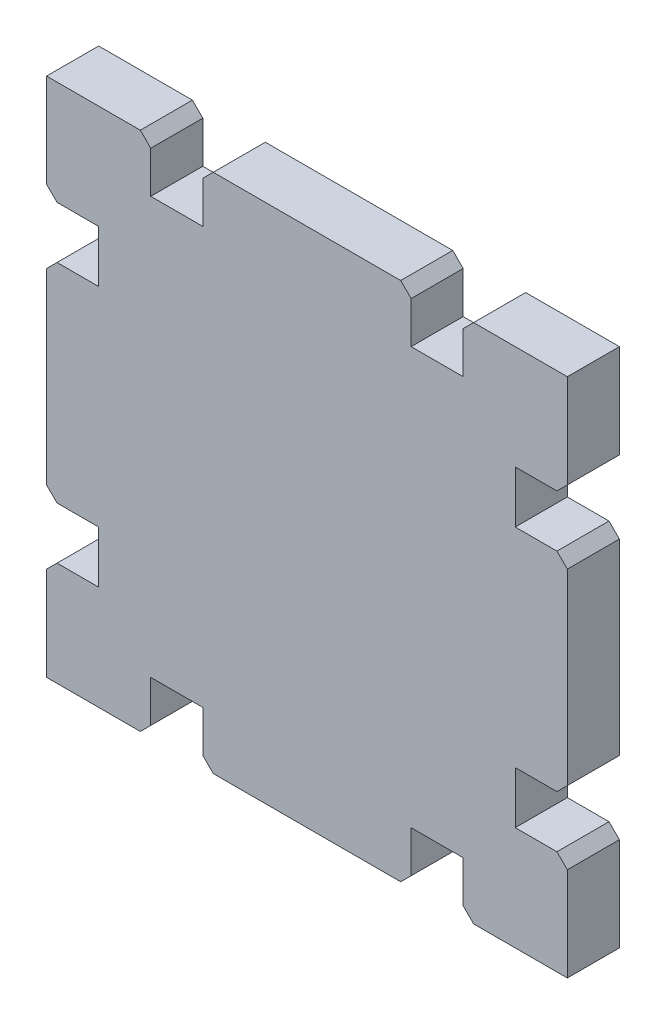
ISO-10303-21;
HEADER;
FILE_DESCRIPTION(('STEP AP214'),'2;1');
FILE_NAME('part.step','',(''),(''),'','','');
FILE_SCHEMA(('AUTOMOTIVE_DESIGN { 1 0 10303 214 1 1 1 1 }'));
ENDSEC;
DATA;
#1=APPLICATION_CONTEXT('core data for automotive mechanical design processes');
#2=APPLICATION_PROTOCOL_DEFINITION('international standard','automotive_design',2000,#1);
#3=PRODUCT_CONTEXT('',#1,'mechanical');
#4=PRODUCT('Part','Part','',(#3));
#5=PRODUCT_RELATED_PRODUCT_CATEGORY('part','',(#4));
#6=PRODUCT_DEFINITION_FORMATION('','',#4);
#7=PRODUCT_DEFINITION_CONTEXT('part definition',#1,'design');
#8=PRODUCT_DEFINITION('design','',#6,#7);
#9=PRODUCT_DEFINITION_SHAPE('','',#8);
#10=(LENGTH_UNIT() NAMED_UNIT(*) SI_UNIT(.MILLI.,.METRE.));
#11=(NAMED_UNIT(*) PLANE_ANGLE_UNIT() SI_UNIT($,.RADIAN.));
#12=(NAMED_UNIT(*) SI_UNIT($,.STERADIAN.) SOLID_ANGLE_UNIT());
#13=UNCERTAINTY_MEASURE_WITH_UNIT(LENGTH_MEASURE(1.E-05),#10,'distance_accuracy_value','');
#14=(GEOMETRIC_REPRESENTATION_CONTEXT(3) GLOBAL_UNCERTAINTY_ASSIGNED_CONTEXT((#13)) GLOBAL_UNIT_ASSIGNED_CONTEXT((#10,
#11,#12)) REPRESENTATION_CONTEXT('',''));
#15=CARTESIAN_POINT('',(0.,0.,0.));
#16=DIRECTION('',(0.,0.,1.));
#17=DIRECTION('',(1.,0.,0.));
#18=AXIS2_PLACEMENT_3D('',#15,#16,#17);
#19=CARTESIAN_POINT('',(16.,25.,5.));
#20=DIRECTION('',(0.,-1.,0.));
#21=DIRECTION('',(0.,0.,-1.));
#22=AXIS2_PLACEMENT_3D('',#19,#20,#21);
#23=PLANE('',#22);
#24=DIRECTION('',(-1.,0.,0.));
#25=VECTOR('',#24,1.);
#26=CARTESIAN_POINT('',(16.,25.,0.));
#27=LINE('',#26,#25);
#28=CARTESIAN_POINT('',(25.,25.,0.));
#29=VERTEX_POINT('',#28);
#30=CARTESIAN_POINT('',(16.,25.,0.));
#31=VERTEX_POINT('',#30);
#32=EDGE_CURVE('E399',#29,#31,#27,.T.);
#33=ORIENTED_EDGE('',*,*,#32,.T.);
#34=DIRECTION('',(0.,0.,-1.));
#35=VECTOR('',#34,1.);
#36=CARTESIAN_POINT('',(16.,25.,5.));
#37=LINE('',#36,#35);
#38=CARTESIAN_POINT('',(16.,25.,5.));
#39=VERTEX_POINT('',#38);
#40=EDGE_CURVE('E11',#39,#31,#37,.T.);
#41=ORIENTED_EDGE('',*,*,#40,.F.);
#42=DIRECTION('',(-1.,0.,0.));
#43=VECTOR('',#42,1.);
#44=CARTESIAN_POINT('',(16.,25.,5.));
#45=LINE('',#44,#43);
#46=CARTESIAN_POINT('',(25.,25.,5.));
#47=VERTEX_POINT('',#46);
#48=EDGE_CURVE('E501',#47,#39,#45,.T.);
#49=ORIENTED_EDGE('',*,*,#48,.F.);
#50=DIRECTION('',(0.,0.,-1.));
#51=VECTOR('',#50,1.);
#52=CARTESIAN_POINT('',(25.,25.,5.));
#53=LINE('',#52,#51);
#54=EDGE_CURVE('E395',#47,#29,#53,.T.);
#55=ORIENTED_EDGE('',*,*,#54,.T.);
#56=EDGE_LOOP('',(#33,#41,#49,#55));
#57=FACE_BOUND('',#56,.T.);
#58=ADVANCED_FACE('F39',(#57),#23,.F.);
#59=CARTESIAN_POINT('',(15.,24.,5.));
#60=DIRECTION('',(0.707106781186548,-0.707106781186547,0.));
#61=DIRECTION('',(0.707106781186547,0.707106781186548,0.));
#62=AXIS2_PLACEMENT_3D('',#59,#60,#61);
#63=PLANE('',#62);
#64=DIRECTION('',(-0.707106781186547,-0.707106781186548,0.));
#65=VECTOR('',#64,1.);
#66=CARTESIAN_POINT('',(15.,24.,0.));
#67=LINE('',#66,#65);
#68=CARTESIAN_POINT('',(15.,24.,0.));
#69=VERTEX_POINT('',#68);
#70=EDGE_CURVE('E402',#31,#69,#67,.T.);
#71=ORIENTED_EDGE('',*,*,#70,.T.);
#72=DIRECTION('',(0.,0.,-1.));
#73=VECTOR('',#72,1.);
#74=CARTESIAN_POINT('',(15.,24.,5.));
#75=LINE('',#74,#73);
#76=CARTESIAN_POINT('',(15.,24.,5.));
#77=VERTEX_POINT('',#76);
#78=EDGE_CURVE('E47',#77,#69,#75,.T.);
#79=ORIENTED_EDGE('',*,*,#78,.F.);
#80=DIRECTION('',(-0.707106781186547,-0.707106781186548,0.));
#81=VECTOR('',#80,1.);
#82=CARTESIAN_POINT('',(15.,24.,5.));
#83=LINE('',#82,#81);
#84=EDGE_CURVE('E230',#39,#77,#83,.T.);
#85=ORIENTED_EDGE('',*,*,#84,.F.);
#86=ORIENTED_EDGE('',*,*,#40,.T.);
#87=EDGE_LOOP('',(#71,#79,#85,#86));
#88=FACE_BOUND('',#87,.T.);
#89=ADVANCED_FACE('F779',(#88),#63,.F.);
#90=CARTESIAN_POINT('',(15.,24.,5.));
#91=DIRECTION('',(1.,0.,0.));
#92=DIRECTION('',(0.,1.,0.));
#93=AXIS2_PLACEMENT_3D('',#90,#91,#92);
#94=PLANE('',#93);
#95=DIRECTION('',(0.,-1.,0.));
#96=VECTOR('',#95,1.);
#97=CARTESIAN_POINT('',(15.,24.,0.));
#98=LINE('',#97,#96);
#99=CARTESIAN_POINT('',(15.,20.,0.));
#100=VERTEX_POINT('',#99);
#101=EDGE_CURVE('E404',#69,#100,#98,.T.);
#102=ORIENTED_EDGE('',*,*,#101,.T.);
#103=DIRECTION('',(0.,0.,-1.));
#104=VECTOR('',#103,1.);
#105=CARTESIAN_POINT('',(15.,20.,5.));
#106=LINE('',#105,#104);
#107=CARTESIAN_POINT('',(15.,20.,5.));
#108=VERTEX_POINT('',#107);
#109=EDGE_CURVE('E640',#108,#100,#106,.T.);
#110=ORIENTED_EDGE('',*,*,#109,.F.);
#111=DIRECTION('',(0.,-1.,0.));
#112=VECTOR('',#111,1.);
#113=CARTESIAN_POINT('',(15.,24.,5.));
#114=LINE('',#113,#112);
#115=EDGE_CURVE('E648',#77,#108,#114,.T.);
#116=ORIENTED_EDGE('',*,*,#115,.F.);
#117=ORIENTED_EDGE('',*,*,#78,.T.);
#118=EDGE_LOOP('',(#102,#110,#116,#117));
#119=FACE_BOUND('',#118,.T.);
#120=ADVANCED_FACE('F646',(#119),#94,.F.);
#121=CARTESIAN_POINT('',(10.,20.,5.));
#122=DIRECTION('',(0.,-1.,0.));
#123=DIRECTION('',(0.,0.,-1.));
#124=AXIS2_PLACEMENT_3D('',#121,#122,#123);
#125=PLANE('',#124);
#126=DIRECTION('',(-1.,0.,0.));
#127=VECTOR('',#126,1.);
#128=CARTESIAN_POINT('',(10.,20.,0.));
#129=LINE('',#128,#127);
#130=CARTESIAN_POINT('',(10.,20.,0.));
#131=VERTEX_POINT('',#130);
#132=EDGE_CURVE('E406',#100,#131,#129,.T.);
#133=ORIENTED_EDGE('',*,*,#132,.T.);
#134=DIRECTION('',(0.,0.,-1.));
#135=VECTOR('',#134,1.);
#136=CARTESIAN_POINT('',(10.,20.,5.));
#137=LINE('',#136,#135);
#138=CARTESIAN_POINT('',(10.,20.,5.));
#139=VERTEX_POINT('',#138);
#140=EDGE_CURVE('E637',#139,#131,#137,.T.);
#141=ORIENTED_EDGE('',*,*,#140,.F.);
#142=DIRECTION('',(-1.,0.,0.));
#143=VECTOR('',#142,1.);
#144=CARTESIAN_POINT('',(10.,20.,5.));
#145=LINE('',#144,#143);
#146=EDGE_CURVE('E666',#108,#139,#145,.T.);
#147=ORIENTED_EDGE('',*,*,#146,.F.);
#148=ORIENTED_EDGE('',*,*,#109,.T.);
#149=EDGE_LOOP('',(#133,#141,#147,#148));
#150=FACE_BOUND('',#149,.T.);
#151=ADVANCED_FACE('F657',(#150),#125,.F.);
#152=CARTESIAN_POINT('',(10.,24.,5.));
#153=DIRECTION('',(-1.,0.,0.));
#154=DIRECTION('',(0.,0.,1.));
#155=AXIS2_PLACEMENT_3D('',#152,#153,#154);
#156=PLANE('',#155);
#157=DIRECTION('',(0.,1.,0.));
#158=VECTOR('',#157,1.);
#159=CARTESIAN_POINT('',(10.,24.,0.));
#160=LINE('',#159,#158);
#161=CARTESIAN_POINT('',(10.,24.,0.));
#162=VERTEX_POINT('',#161);
#163=EDGE_CURVE('E408',#131,#162,#160,.T.);
#164=ORIENTED_EDGE('',*,*,#163,.T.);
#165=DIRECTION('',(0.,0.,-1.));
#166=VECTOR('',#165,1.);
#167=CARTESIAN_POINT('',(10.,24.,5.));
#168=LINE('',#167,#166);
#169=CARTESIAN_POINT('',(10.,24.,5.));
#170=VERTEX_POINT('',#169);
#171=EDGE_CURVE('E634',#170,#162,#168,.T.);
#172=ORIENTED_EDGE('',*,*,#171,.F.);
#173=DIRECTION('',(0.,1.,0.));
#174=VECTOR('',#173,1.);
#175=CARTESIAN_POINT('',(10.,24.,5.));
#176=LINE('',#175,#174);
#177=EDGE_CURVE('E663',#139,#170,#176,.T.);
#178=ORIENTED_EDGE('',*,*,#177,.F.);
#179=ORIENTED_EDGE('',*,*,#140,.T.);
#180=EDGE_LOOP('',(#164,#172,#178,#179));
#181=FACE_BOUND('',#180,.T.);
#182=ADVANCED_FACE('F661',(#181),#156,.F.);
#183=CARTESIAN_POINT('',(9.00000000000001,25.,5.));
#184=DIRECTION('',(-0.707106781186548,-0.707106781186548,0.));
#185=DIRECTION('',(0.707106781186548,-0.707106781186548,0.));
#186=AXIS2_PLACEMENT_3D('',#183,#184,#185);
#187=PLANE('',#186);
#188=DIRECTION('',(-0.707106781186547,0.707106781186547,0.));
#189=VECTOR('',#188,1.);
#190=CARTESIAN_POINT('',(9.00000000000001,25.,0.));
#191=LINE('',#190,#189);
#192=CARTESIAN_POINT('',(9.00000000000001,25.,0.));
#193=VERTEX_POINT('',#192);
#194=EDGE_CURVE('E410',#162,#193,#191,.T.);
#195=ORIENTED_EDGE('',*,*,#194,.T.);
#196=DIRECTION('',(0.,0.,-1.));
#197=VECTOR('',#196,1.);
#198=CARTESIAN_POINT('',(9.00000000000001,25.,5.));
#199=LINE('',#198,#197);
#200=CARTESIAN_POINT('',(9.00000000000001,25.,5.));
#201=VERTEX_POINT('',#200);
#202=EDGE_CURVE('E631',#201,#193,#199,.T.);
#203=ORIENTED_EDGE('',*,*,#202,.F.);
#204=DIRECTION('',(-0.707106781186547,0.707106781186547,0.));
#205=VECTOR('',#204,1.);
#206=CARTESIAN_POINT('',(9.00000000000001,25.,5.));
#207=LINE('',#206,#205);
#208=EDGE_CURVE('E665',#170,#201,#207,.T.);
#209=ORIENTED_EDGE('',*,*,#208,.F.);
#210=ORIENTED_EDGE('',*,*,#171,.T.);
#211=EDGE_LOOP('',(#195,#203,#209,#210));
#212=FACE_BOUND('',#211,.T.);
#213=ADVANCED_FACE('F792',(#212),#187,.F.);
#214=CARTESIAN_POINT('',(-9.,25.,5.));
#215=DIRECTION('',(0.,-1.,0.));
#216=DIRECTION('',(0.,0.,-1.));
#217=AXIS2_PLACEMENT_3D('',#214,#215,#216);
#218=PLANE('',#217);
#219=DIRECTION('',(-1.,0.,0.));
#220=VECTOR('',#219,1.);
#221=CARTESIAN_POINT('',(-9.,25.,0.));
#222=LINE('',#221,#220);
#223=CARTESIAN_POINT('',(-9.,25.,0.));
#224=VERTEX_POINT('',#223);
#225=EDGE_CURVE('E412',#193,#224,#222,.T.);
#226=ORIENTED_EDGE('',*,*,#225,.T.);
#227=DIRECTION('',(0.,0.,-1.));
#228=VECTOR('',#227,1.);
#229=CARTESIAN_POINT('',(-9.,25.,5.));
#230=LINE('',#229,#228);
#231=CARTESIAN_POINT('',(-9.,25.,5.));
#232=VERTEX_POINT('',#231);
#233=EDGE_CURVE('E628',#232,#224,#230,.T.);
#234=ORIENTED_EDGE('',*,*,#233,.F.);
#235=DIRECTION('',(-1.,0.,0.));
#236=VECTOR('',#235,1.);
#237=CARTESIAN_POINT('',(-9.,25.,5.));
#238=LINE('',#237,#236);
#239=EDGE_CURVE('E668',#201,#232,#238,.T.);
#240=ORIENTED_EDGE('',*,*,#239,.F.);
#241=ORIENTED_EDGE('',*,*,#202,.T.);
#242=EDGE_LOOP('',(#226,#234,#240,#241));
#243=FACE_BOUND('',#242,.T.);
#244=ADVANCED_FACE('F795',(#243),#218,.F.);
#245=CARTESIAN_POINT('',(-10.,24.,5.));
#246=DIRECTION('',(0.707106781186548,-0.707106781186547,0.));
#247=DIRECTION('',(0.707106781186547,0.707106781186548,0.));
#248=AXIS2_PLACEMENT_3D('',#245,#246,#247);
#249=PLANE('',#248);
#250=DIRECTION('',(-0.707106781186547,-0.707106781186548,0.));
#251=VECTOR('',#250,1.);
#252=CARTESIAN_POINT('',(-10.,24.,0.));
#253=LINE('',#252,#251);
#254=CARTESIAN_POINT('',(-10.,24.,0.));
#255=VERTEX_POINT('',#254);
#256=EDGE_CURVE('E414',#224,#255,#253,.T.);
#257=ORIENTED_EDGE('',*,*,#256,.T.);
#258=DIRECTION('',(0.,0.,-1.));
#259=VECTOR('',#258,1.);
#260=CARTESIAN_POINT('',(-10.,24.,5.));
#261=LINE('',#260,#259);
#262=CARTESIAN_POINT('',(-10.,24.,5.));
#263=VERTEX_POINT('',#262);
#264=EDGE_CURVE('E625',#263,#255,#261,.T.);
#265=ORIENTED_EDGE('',*,*,#264,.F.);
#266=DIRECTION('',(-0.707106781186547,-0.707106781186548,0.));
#267=VECTOR('',#266,1.);
#268=CARTESIAN_POINT('',(-10.,24.,5.));
#269=LINE('',#268,#267);
#270=EDGE_CURVE('E674',#232,#263,#269,.T.);
#271=ORIENTED_EDGE('',*,*,#270,.F.);
#272=ORIENTED_EDGE('',*,*,#233,.T.);
#273=EDGE_LOOP('',(#257,#265,#271,#272));
#274=FACE_BOUND('',#273,.T.);
#275=ADVANCED_FACE('F799',(#274),#249,.F.);
#276=CARTESIAN_POINT('',(-10.,24.,5.));
#277=DIRECTION('',(1.,0.,0.));
#278=DIRECTION('',(0.,1.,0.));
#279=AXIS2_PLACEMENT_3D('',#276,#277,#278);
#280=PLANE('',#279);
#281=DIRECTION('',(0.,-1.,0.));
#282=VECTOR('',#281,1.);
#283=CARTESIAN_POINT('',(-10.,24.,0.));
#284=LINE('',#283,#282);
#285=CARTESIAN_POINT('',(-9.99999999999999,20.,0.));
#286=VERTEX_POINT('',#285);
#287=EDGE_CURVE('E416',#255,#286,#284,.T.);
#288=ORIENTED_EDGE('',*,*,#287,.T.);
#289=DIRECTION('',(0.,0.,-1.));
#290=VECTOR('',#289,1.);
#291=CARTESIAN_POINT('',(-9.99999999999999,20.,5.));
#292=LINE('',#291,#290);
#293=CARTESIAN_POINT('',(-9.99999999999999,20.,5.));
#294=VERTEX_POINT('',#293);
#295=EDGE_CURVE('E622',#294,#286,#292,.T.);
#296=ORIENTED_EDGE('',*,*,#295,.F.);
#297=DIRECTION('',(0.,-1.,0.));
#298=VECTOR('',#297,1.);
#299=CARTESIAN_POINT('',(-10.,24.,5.));
#300=LINE('',#299,#298);
#301=EDGE_CURVE('E676',#263,#294,#300,.T.);
#302=ORIENTED_EDGE('',*,*,#301,.F.);
#303=ORIENTED_EDGE('',*,*,#264,.T.);
#304=EDGE_LOOP('',(#288,#296,#302,#303));
#305=FACE_BOUND('',#304,.T.);
#306=ADVANCED_FACE('F803',(#305),#280,.F.);
#307=CARTESIAN_POINT('',(-9.99999999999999,20.,5.));
#308=DIRECTION('',(0.,-1.,0.));
#309=DIRECTION('',(0.,0.,-1.));
#310=AXIS2_PLACEMENT_3D('',#307,#308,#309);
#311=PLANE('',#310);
#312=DIRECTION('',(-1.,0.,0.));
#313=VECTOR('',#312,1.);
#314=CARTESIAN_POINT('',(-9.99999999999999,20.,0.));
#315=LINE('',#314,#313);
#316=CARTESIAN_POINT('',(-15.,20.,0.));
#317=VERTEX_POINT('',#316);
#318=EDGE_CURVE('E418',#286,#317,#315,.T.);
#319=ORIENTED_EDGE('',*,*,#318,.T.);
#320=DIRECTION('',(0.,0.,-1.));
#321=VECTOR('',#320,1.);
#322=CARTESIAN_POINT('',(-15.,20.,5.));
#323=LINE('',#322,#321);
#324=CARTESIAN_POINT('',(-15.,20.,5.));
#325=VERTEX_POINT('',#324);
#326=EDGE_CURVE('E619',#325,#317,#323,.T.);
#327=ORIENTED_EDGE('',*,*,#326,.F.);
#328=DIRECTION('',(-1.,0.,0.));
#329=VECTOR('',#328,1.);
#330=CARTESIAN_POINT('',(-9.99999999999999,20.,5.));
#331=LINE('',#330,#329);
#332=EDGE_CURVE('E678',#294,#325,#331,.T.);
#333=ORIENTED_EDGE('',*,*,#332,.F.);
#334=ORIENTED_EDGE('',*,*,#295,.T.);
#335=EDGE_LOOP('',(#319,#327,#333,#334));
#336=FACE_BOUND('',#335,.T.);
#337=ADVANCED_FACE('F807',(#336),#311,.F.);
#338=CARTESIAN_POINT('',(-15.,24.,5.));
#339=DIRECTION('',(-1.,0.,0.));
#340=DIRECTION('',(0.,-1.,0.));
#341=AXIS2_PLACEMENT_3D('',#338,#339,#340);
#342=PLANE('',#341);
#343=DIRECTION('',(0.,1.,0.));
#344=VECTOR('',#343,1.);
#345=CARTESIAN_POINT('',(-15.,24.,0.));
#346=LINE('',#345,#344);
#347=CARTESIAN_POINT('',(-15.,24.,0.));
#348=VERTEX_POINT('',#347);
#349=EDGE_CURVE('E420',#317,#348,#346,.T.);
#350=ORIENTED_EDGE('',*,*,#349,.T.);
#351=DIRECTION('',(0.,0.,-1.));
#352=VECTOR('',#351,1.);
#353=CARTESIAN_POINT('',(-15.,24.,5.));
#354=LINE('',#353,#352);
#355=CARTESIAN_POINT('',(-15.,24.,5.));
#356=VERTEX_POINT('',#355);
#357=EDGE_CURVE('E616',#356,#348,#354,.T.);
#358=ORIENTED_EDGE('',*,*,#357,.F.);
#359=DIRECTION('',(0.,1.,0.));
#360=VECTOR('',#359,1.);
#361=CARTESIAN_POINT('',(-15.,24.,5.));
#362=LINE('',#361,#360);
#363=EDGE_CURVE('E680',#325,#356,#362,.T.);
#364=ORIENTED_EDGE('',*,*,#363,.F.);
#365=ORIENTED_EDGE('',*,*,#326,.T.);
#366=EDGE_LOOP('',(#350,#358,#364,#365));
#367=FACE_BOUND('',#366,.T.);
#368=ADVANCED_FACE('F811',(#367),#342,.F.);
#369=CARTESIAN_POINT('',(-16.,25.,5.));
#370=DIRECTION('',(-0.707106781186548,-0.707106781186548,0.));
#371=DIRECTION('',(0.707106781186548,-0.707106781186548,0.));
#372=AXIS2_PLACEMENT_3D('',#369,#370,#371);
#373=PLANE('',#372);
#374=DIRECTION('',(-0.707106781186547,0.707106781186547,0.));
#375=VECTOR('',#374,1.);
#376=CARTESIAN_POINT('',(-16.,25.,0.));
#377=LINE('',#376,#375);
#378=CARTESIAN_POINT('',(-16.,25.,0.));
#379=VERTEX_POINT('',#378);
#380=EDGE_CURVE('E422',#348,#379,#377,.T.);
#381=ORIENTED_EDGE('',*,*,#380,.T.);
#382=DIRECTION('',(0.,0.,-1.));
#383=VECTOR('',#382,1.);
#384=CARTESIAN_POINT('',(-16.,25.,5.));
#385=LINE('',#384,#383);
#386=CARTESIAN_POINT('',(-16.,25.,5.));
#387=VERTEX_POINT('',#386);
#388=EDGE_CURVE('E613',#387,#379,#385,.T.);
#389=ORIENTED_EDGE('',*,*,#388,.F.);
#390=DIRECTION('',(-0.707106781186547,0.707106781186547,0.));
#391=VECTOR('',#390,1.);
#392=CARTESIAN_POINT('',(-16.,25.,5.));
#393=LINE('',#392,#391);
#394=EDGE_CURVE('E682',#356,#387,#393,.T.);
#395=ORIENTED_EDGE('',*,*,#394,.F.);
#396=ORIENTED_EDGE('',*,*,#357,.T.);
#397=EDGE_LOOP('',(#381,#389,#395,#396));
#398=FACE_BOUND('',#397,.T.);
#399=ADVANCED_FACE('F815',(#398),#373,.F.);
#400=CARTESIAN_POINT('',(-25.,25.,5.));
#401=DIRECTION('',(0.,-1.,0.));
#402=DIRECTION('',(1.,0.,0.));
#403=AXIS2_PLACEMENT_3D('',#400,#401,#402);
#404=PLANE('',#403);
#405=DIRECTION('',(-1.,0.,0.));
#406=VECTOR('',#405,1.);
#407=CARTESIAN_POINT('',(-25.,25.,0.));
#408=LINE('',#407,#406);
#409=CARTESIAN_POINT('',(-25.,25.,0.));
#410=VERTEX_POINT('',#409);
#411=EDGE_CURVE('E424',#379,#410,#408,.T.);
#412=ORIENTED_EDGE('',*,*,#411,.T.);
#413=DIRECTION('',(0.,0.,-1.));
#414=VECTOR('',#413,1.);
#415=CARTESIAN_POINT('',(-25.,25.,5.));
#416=LINE('',#415,#414);
#417=CARTESIAN_POINT('',(-25.,25.,5.));
#418=VERTEX_POINT('',#417);
#419=EDGE_CURVE('E610',#418,#410,#416,.T.);
#420=ORIENTED_EDGE('',*,*,#419,.F.);
#421=DIRECTION('',(-1.,0.,0.));
#422=VECTOR('',#421,1.);
#423=CARTESIAN_POINT('',(-25.,25.,5.));
#424=LINE('',#423,#422);
#425=EDGE_CURVE('E684',#387,#418,#424,.T.);
#426=ORIENTED_EDGE('',*,*,#425,.F.);
#427=ORIENTED_EDGE('',*,*,#388,.T.);
#428=EDGE_LOOP('',(#412,#420,#426,#427));
#429=FACE_BOUND('',#428,.T.);
#430=ADVANCED_FACE('F819',(#429),#404,.F.);
#431=CARTESIAN_POINT('',(-25.,16.,5.));
#432=DIRECTION('',(1.,0.,0.));
#433=DIRECTION('',(0.,0.,-1.));
#434=AXIS2_PLACEMENT_3D('',#431,#432,#433);
#435=PLANE('',#434);
#436=DIRECTION('',(0.,-1.,0.));
#437=VECTOR('',#436,1.);
#438=CARTESIAN_POINT('',(-25.,16.,0.));
#439=LINE('',#438,#437);
#440=CARTESIAN_POINT('',(-25.,16.,0.));
#441=VERTEX_POINT('',#440);
#442=EDGE_CURVE('E426',#410,#441,#439,.T.);
#443=ORIENTED_EDGE('',*,*,#442,.T.);
#444=DIRECTION('',(0.,0.,-1.));
#445=VECTOR('',#444,1.);
#446=CARTESIAN_POINT('',(-25.,16.,5.));
#447=LINE('',#446,#445);
#448=CARTESIAN_POINT('',(-25.,16.,5.));
#449=VERTEX_POINT('',#448);
#450=EDGE_CURVE('E607',#449,#441,#447,.T.);
#451=ORIENTED_EDGE('',*,*,#450,.F.);
#452=DIRECTION('',(0.,-1.,0.));
#453=VECTOR('',#452,1.);
#454=CARTESIAN_POINT('',(-25.,16.,5.));
#455=LINE('',#454,#453);
#456=EDGE_CURVE('E686',#418,#449,#455,.T.);
#457=ORIENTED_EDGE('',*,*,#456,.F.);
#458=ORIENTED_EDGE('',*,*,#419,.T.);
#459=EDGE_LOOP('',(#443,#451,#457,#458));
#460=FACE_BOUND('',#459,.T.);
#461=ADVANCED_FACE('F823',(#460),#435,.F.);
#462=CARTESIAN_POINT('',(-24.,15.,5.));
#463=DIRECTION('',(0.707106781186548,0.707106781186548,0.));
#464=DIRECTION('',(-0.707106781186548,0.707106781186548,0.));
#465=AXIS2_PLACEMENT_3D('',#462,#463,#464);
#466=PLANE('',#465);
#467=DIRECTION('',(0.707106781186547,-0.707106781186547,0.));
#468=VECTOR('',#467,1.);
#469=CARTESIAN_POINT('',(-24.,15.,0.));
#470=LINE('',#469,#468);
#471=CARTESIAN_POINT('',(-24.,15.,0.));
#472=VERTEX_POINT('',#471);
#473=EDGE_CURVE('E428',#441,#472,#470,.T.);
#474=ORIENTED_EDGE('',*,*,#473,.T.);
#475=DIRECTION('',(0.,0.,-1.));
#476=VECTOR('',#475,1.);
#477=CARTESIAN_POINT('',(-24.,15.,5.));
#478=LINE('',#477,#476);
#479=CARTESIAN_POINT('',(-24.,15.,5.));
#480=VERTEX_POINT('',#479);
#481=EDGE_CURVE('E604',#480,#472,#478,.T.);
#482=ORIENTED_EDGE('',*,*,#481,.F.);
#483=DIRECTION('',(0.707106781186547,-0.707106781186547,0.));
#484=VECTOR('',#483,1.);
#485=CARTESIAN_POINT('',(-24.,15.,5.));
#486=LINE('',#485,#484);
#487=EDGE_CURVE('E688',#449,#480,#486,.T.);
#488=ORIENTED_EDGE('',*,*,#487,.F.);
#489=ORIENTED_EDGE('',*,*,#450,.T.);
#490=EDGE_LOOP('',(#474,#482,#488,#489));
#491=FACE_BOUND('',#490,.T.);
#492=ADVANCED_FACE('F827',(#491),#466,.F.);
#493=CARTESIAN_POINT('',(-24.,15.,5.));
#494=DIRECTION('',(0.,1.,0.));
#495=DIRECTION('',(0.,0.,1.));
#496=AXIS2_PLACEMENT_3D('',#493,#494,#495);
#497=PLANE('',#496);
#498=DIRECTION('',(1.,0.,0.));
#499=VECTOR('',#498,1.);
#500=CARTESIAN_POINT('',(-24.,15.,0.));
#501=LINE('',#500,#499);
#502=CARTESIAN_POINT('',(-20.,15.,0.));
#503=VERTEX_POINT('',#502);
#504=EDGE_CURVE('E430',#472,#503,#501,.T.);
#505=ORIENTED_EDGE('',*,*,#504,.T.);
#506=DIRECTION('',(0.,0.,-1.));
#507=VECTOR('',#506,1.);
#508=CARTESIAN_POINT('',(-20.,15.,5.));
#509=LINE('',#508,#507);
#510=CARTESIAN_POINT('',(-20.,15.,5.));
#511=VERTEX_POINT('',#510);
#512=EDGE_CURVE('E601',#511,#503,#509,.T.);
#513=ORIENTED_EDGE('',*,*,#512,.F.);
#514=DIRECTION('',(1.,0.,0.));
#515=VECTOR('',#514,1.);
#516=CARTESIAN_POINT('',(-24.,15.,5.));
#517=LINE('',#516,#515);
#518=EDGE_CURVE('E690',#480,#511,#517,.T.);
#519=ORIENTED_EDGE('',*,*,#518,.F.);
#520=ORIENTED_EDGE('',*,*,#481,.T.);
#521=EDGE_LOOP('',(#505,#513,#519,#520));
#522=FACE_BOUND('',#521,.T.);
#523=ADVANCED_FACE('F831',(#522),#497,.F.);
#524=CARTESIAN_POINT('',(-20.,10.,5.));
#525=DIRECTION('',(1.,0.,0.));
#526=DIRECTION('',(0.,0.,-1.));
#527=AXIS2_PLACEMENT_3D('',#524,#525,#526);
#528=PLANE('',#527);
#529=DIRECTION('',(0.,-1.,0.));
#530=VECTOR('',#529,1.);
#531=CARTESIAN_POINT('',(-20.,10.,0.));
#532=LINE('',#531,#530);
#533=CARTESIAN_POINT('',(-20.,10.,0.));
#534=VERTEX_POINT('',#533);
#535=EDGE_CURVE('E432',#503,#534,#532,.T.);
#536=ORIENTED_EDGE('',*,*,#535,.T.);
#537=DIRECTION('',(0.,0.,-1.));
#538=VECTOR('',#537,1.);
#539=CARTESIAN_POINT('',(-20.,10.,5.));
#540=LINE('',#539,#538);
#541=CARTESIAN_POINT('',(-20.,10.,5.));
#542=VERTEX_POINT('',#541);
#543=EDGE_CURVE('E598',#542,#534,#540,.T.);
#544=ORIENTED_EDGE('',*,*,#543,.F.);
#545=DIRECTION('',(0.,-1.,0.));
#546=VECTOR('',#545,1.);
#547=CARTESIAN_POINT('',(-20.,10.,5.));
#548=LINE('',#547,#546);
#549=EDGE_CURVE('E692',#511,#542,#548,.T.);
#550=ORIENTED_EDGE('',*,*,#549,.F.);
#551=ORIENTED_EDGE('',*,*,#512,.T.);
#552=EDGE_LOOP('',(#536,#544,#550,#551));
#553=FACE_BOUND('',#552,.T.);
#554=ADVANCED_FACE('F835',(#553),#528,.F.);
#555=CARTESIAN_POINT('',(-24.,10.,5.));
#556=DIRECTION('',(0.,-1.,0.));
#557=DIRECTION('',(0.,0.,-1.));
#558=AXIS2_PLACEMENT_3D('',#555,#556,#557);
#559=PLANE('',#558);
#560=DIRECTION('',(-1.,0.,0.));
#561=VECTOR('',#560,1.);
#562=CARTESIAN_POINT('',(-24.,10.,0.));
#563=LINE('',#562,#561);
#564=CARTESIAN_POINT('',(-24.,10.,0.));
#565=VERTEX_POINT('',#564);
#566=EDGE_CURVE('E434',#534,#565,#563,.T.);
#567=ORIENTED_EDGE('',*,*,#566,.T.);
#568=DIRECTION('',(0.,0.,-1.));
#569=VECTOR('',#568,1.);
#570=CARTESIAN_POINT('',(-24.,10.,5.));
#571=LINE('',#570,#569);
#572=CARTESIAN_POINT('',(-24.,10.,5.));
#573=VERTEX_POINT('',#572);
#574=EDGE_CURVE('E595',#573,#565,#571,.T.);
#575=ORIENTED_EDGE('',*,*,#574,.F.);
#576=DIRECTION('',(-1.,0.,0.));
#577=VECTOR('',#576,1.);
#578=CARTESIAN_POINT('',(-24.,10.,5.));
#579=LINE('',#578,#577);
#580=EDGE_CURVE('E694',#542,#573,#579,.T.);
#581=ORIENTED_EDGE('',*,*,#580,.F.);
#582=ORIENTED_EDGE('',*,*,#543,.T.);
#583=EDGE_LOOP('',(#567,#575,#581,#582));
#584=FACE_BOUND('',#583,.T.);
#585=ADVANCED_FACE('F839',(#584),#559,.F.);
#586=CARTESIAN_POINT('',(-25.,9.,5.));
#587=DIRECTION('',(0.707106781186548,-0.707106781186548,0.));
#588=DIRECTION('',(0.707106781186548,0.707106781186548,0.));
#589=AXIS2_PLACEMENT_3D('',#586,#587,#588);
#590=PLANE('',#589);
#591=DIRECTION('',(-0.707106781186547,-0.707106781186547,0.));
#592=VECTOR('',#591,1.);
#593=CARTESIAN_POINT('',(-25.,9.,0.));
#594=LINE('',#593,#592);
#595=CARTESIAN_POINT('',(-25.,9.,0.));
#596=VERTEX_POINT('',#595);
#597=EDGE_CURVE('E436',#565,#596,#594,.T.);
#598=ORIENTED_EDGE('',*,*,#597,.T.);
#599=DIRECTION('',(0.,0.,-1.));
#600=VECTOR('',#599,1.);
#601=CARTESIAN_POINT('',(-25.,9.,5.));
#602=LINE('',#601,#600);
#603=CARTESIAN_POINT('',(-25.,9.,5.));
#604=VERTEX_POINT('',#603);
#605=EDGE_CURVE('E592',#604,#596,#602,.T.);
#606=ORIENTED_EDGE('',*,*,#605,.F.);
#607=DIRECTION('',(-0.707106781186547,-0.707106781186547,0.));
#608=VECTOR('',#607,1.);
#609=CARTESIAN_POINT('',(-25.,9.,5.));
#610=LINE('',#609,#608);
#611=EDGE_CURVE('E696',#573,#604,#610,.T.);
#612=ORIENTED_EDGE('',*,*,#611,.F.);
#613=ORIENTED_EDGE('',*,*,#574,.T.);
#614=EDGE_LOOP('',(#598,#606,#612,#613));
#615=FACE_BOUND('',#614,.T.);
#616=ADVANCED_FACE('F843',(#615),#590,.F.);
#617=CARTESIAN_POINT('',(-25.,-9.,5.));
#618=DIRECTION('',(1.,0.,0.));
#619=DIRECTION('',(0.,1.,0.));
#620=AXIS2_PLACEMENT_3D('',#617,#618,#619);
#621=PLANE('',#620);
#622=DIRECTION('',(0.,-1.,0.));
#623=VECTOR('',#622,1.);
#624=CARTESIAN_POINT('',(-25.,-9.,0.));
#625=LINE('',#624,#623);
#626=CARTESIAN_POINT('',(-25.,-9.,0.));
#627=VERTEX_POINT('',#626);
#628=EDGE_CURVE('E438',#596,#627,#625,.T.);
#629=ORIENTED_EDGE('',*,*,#628,.T.);
#630=DIRECTION('',(0.,0.,-1.));
#631=VECTOR('',#630,1.);
#632=CARTESIAN_POINT('',(-25.,-9.,5.));
#633=LINE('',#632,#631);
#634=CARTESIAN_POINT('',(-25.,-9.,5.));
#635=VERTEX_POINT('',#634);
#636=EDGE_CURVE('E589',#635,#627,#633,.T.);
#637=ORIENTED_EDGE('',*,*,#636,.F.);
#638=DIRECTION('',(0.,-1.,0.));
#639=VECTOR('',#638,1.);
#640=CARTESIAN_POINT('',(-25.,-9.,5.));
#641=LINE('',#640,#639);
#642=EDGE_CURVE('E698',#604,#635,#641,.T.);
#643=ORIENTED_EDGE('',*,*,#642,.F.);
#644=ORIENTED_EDGE('',*,*,#605,.T.);
#645=EDGE_LOOP('',(#629,#637,#643,#644));
#646=FACE_BOUND('',#645,.T.);
#647=ADVANCED_FACE('F847',(#646),#621,.F.);
#648=CARTESIAN_POINT('',(-24.,-10.,5.));
#649=DIRECTION('',(0.707106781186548,0.707106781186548,0.));
#650=DIRECTION('',(-0.707106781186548,0.707106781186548,0.));
#651=AXIS2_PLACEMENT_3D('',#648,#649,#650);
#652=PLANE('',#651);
#653=DIRECTION('',(0.707106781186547,-0.707106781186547,0.));
#654=VECTOR('',#653,1.);
#655=CARTESIAN_POINT('',(-24.,-10.,0.));
#656=LINE('',#655,#654);
#657=CARTESIAN_POINT('',(-24.,-10.,0.));
#658=VERTEX_POINT('',#657);
#659=EDGE_CURVE('E440',#627,#658,#656,.T.);
#660=ORIENTED_EDGE('',*,*,#659,.T.);
#661=DIRECTION('',(0.,0.,-1.));
#662=VECTOR('',#661,1.);
#663=CARTESIAN_POINT('',(-24.,-10.,5.));
#664=LINE('',#663,#662);
#665=CARTESIAN_POINT('',(-24.,-10.,5.));
#666=VERTEX_POINT('',#665);
#667=EDGE_CURVE('E586',#666,#658,#664,.T.);
#668=ORIENTED_EDGE('',*,*,#667,.F.);
#669=DIRECTION('',(0.707106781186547,-0.707106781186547,0.));
#670=VECTOR('',#669,1.);
#671=CARTESIAN_POINT('',(-24.,-10.,5.));
#672=LINE('',#671,#670);
#673=EDGE_CURVE('E700',#635,#666,#672,.T.);
#674=ORIENTED_EDGE('',*,*,#673,.F.);
#675=ORIENTED_EDGE('',*,*,#636,.T.);
#676=EDGE_LOOP('',(#660,#668,#674,#675));
#677=FACE_BOUND('',#676,.T.);
#678=ADVANCED_FACE('F851',(#677),#652,.F.);
#679=CARTESIAN_POINT('',(-24.,-10.,5.));
#680=DIRECTION('',(0.,1.,0.));
#681=DIRECTION('',(0.,0.,1.));
#682=AXIS2_PLACEMENT_3D('',#679,#680,#681);
#683=PLANE('',#682);
#684=DIRECTION('',(1.,0.,0.));
#685=VECTOR('',#684,1.);
#686=CARTESIAN_POINT('',(-24.,-10.,0.));
#687=LINE('',#686,#685);
#688=CARTESIAN_POINT('',(-20.,-10.,0.));
#689=VERTEX_POINT('',#688);
#690=EDGE_CURVE('E442',#658,#689,#687,.T.);
#691=ORIENTED_EDGE('',*,*,#690,.T.);
#692=DIRECTION('',(0.,0.,-1.));
#693=VECTOR('',#692,1.);
#694=CARTESIAN_POINT('',(-20.,-10.,5.));
#695=LINE('',#694,#693);
#696=CARTESIAN_POINT('',(-20.,-10.,5.));
#697=VERTEX_POINT('',#696);
#698=EDGE_CURVE('E583',#697,#689,#695,.T.);
#699=ORIENTED_EDGE('',*,*,#698,.F.);
#700=DIRECTION('',(1.,0.,0.));
#701=VECTOR('',#700,1.);
#702=CARTESIAN_POINT('',(-24.,-10.,5.));
#703=LINE('',#702,#701);
#704=EDGE_CURVE('E702',#666,#697,#703,.T.);
#705=ORIENTED_EDGE('',*,*,#704,.F.);
#706=ORIENTED_EDGE('',*,*,#667,.T.);
#707=EDGE_LOOP('',(#691,#699,#705,#706));
#708=FACE_BOUND('',#707,.T.);
#709=ADVANCED_FACE('F855',(#708),#683,.F.);
#710=CARTESIAN_POINT('',(-20.,-10.,5.));
#711=DIRECTION('',(1.,0.,0.));
#712=DIRECTION('',(0.,0.,-1.));
#713=AXIS2_PLACEMENT_3D('',#710,#711,#712);
#714=PLANE('',#713);
#715=DIRECTION('',(0.,-1.,0.));
#716=VECTOR('',#715,1.);
#717=CARTESIAN_POINT('',(-20.,-10.,0.));
#718=LINE('',#717,#716);
#719=CARTESIAN_POINT('',(-20.,-15.,0.));
#720=VERTEX_POINT('',#719);
#721=EDGE_CURVE('E444',#689,#720,#718,.T.);
#722=ORIENTED_EDGE('',*,*,#721,.T.);
#723=DIRECTION('',(0.,0.,-1.));
#724=VECTOR('',#723,1.);
#725=CARTESIAN_POINT('',(-20.,-15.,5.));
#726=LINE('',#725,#724);
#727=CARTESIAN_POINT('',(-20.,-15.,5.));
#728=VERTEX_POINT('',#727);
#729=EDGE_CURVE('E580',#728,#720,#726,.T.);
#730=ORIENTED_EDGE('',*,*,#729,.F.);
#731=DIRECTION('',(0.,-1.,0.));
#732=VECTOR('',#731,1.);
#733=CARTESIAN_POINT('',(-20.,-10.,5.));
#734=LINE('',#733,#732);
#735=EDGE_CURVE('E704',#697,#728,#734,.T.);
#736=ORIENTED_EDGE('',*,*,#735,.F.);
#737=ORIENTED_EDGE('',*,*,#698,.T.);
#738=EDGE_LOOP('',(#722,#730,#736,#737));
#739=FACE_BOUND('',#738,.T.);
#740=ADVANCED_FACE('F859',(#739),#714,.F.);
#741=CARTESIAN_POINT('',(-24.,-15.,5.));
#742=DIRECTION('',(0.,-1.,0.));
#743=DIRECTION('',(0.,0.,-1.));
#744=AXIS2_PLACEMENT_3D('',#741,#742,#743);
#745=PLANE('',#744);
#746=DIRECTION('',(-1.,0.,0.));
#747=VECTOR('',#746,1.);
#748=CARTESIAN_POINT('',(-24.,-15.,0.));
#749=LINE('',#748,#747);
#750=CARTESIAN_POINT('',(-24.,-15.,0.));
#751=VERTEX_POINT('',#750);
#752=EDGE_CURVE('E446',#720,#751,#749,.T.);
#753=ORIENTED_EDGE('',*,*,#752,.T.);
#754=DIRECTION('',(0.,0.,-1.));
#755=VECTOR('',#754,1.);
#756=CARTESIAN_POINT('',(-24.,-15.,5.));
#757=LINE('',#756,#755);
#758=CARTESIAN_POINT('',(-24.,-15.,5.));
#759=VERTEX_POINT('',#758);
#760=EDGE_CURVE('E577',#759,#751,#757,.T.);
#761=ORIENTED_EDGE('',*,*,#760,.F.);
#762=DIRECTION('',(-1.,0.,0.));
#763=VECTOR('',#762,1.);
#764=CARTESIAN_POINT('',(-24.,-15.,5.));
#765=LINE('',#764,#763);
#766=EDGE_CURVE('E706',#728,#759,#765,.T.);
#767=ORIENTED_EDGE('',*,*,#766,.F.);
#768=ORIENTED_EDGE('',*,*,#729,.T.);
#769=EDGE_LOOP('',(#753,#761,#767,#768));
#770=FACE_BOUND('',#769,.T.);
#771=ADVANCED_FACE('F863',(#770),#745,.F.);
#772=CARTESIAN_POINT('',(-25.,-16.,5.));
#773=DIRECTION('',(0.707106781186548,-0.707106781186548,0.));
#774=DIRECTION('',(0.707106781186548,0.707106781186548,0.));
#775=AXIS2_PLACEMENT_3D('',#772,#773,#774);
#776=PLANE('',#775);
#777=DIRECTION('',(-0.707106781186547,-0.707106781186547,0.));
#778=VECTOR('',#777,1.);
#779=CARTESIAN_POINT('',(-25.,-16.,0.));
#780=LINE('',#779,#778);
#781=CARTESIAN_POINT('',(-25.,-16.,0.));
#782=VERTEX_POINT('',#781);
#783=EDGE_CURVE('E448',#751,#782,#780,.T.);
#784=ORIENTED_EDGE('',*,*,#783,.T.);
#785=DIRECTION('',(0.,0.,-1.));
#786=VECTOR('',#785,1.);
#787=CARTESIAN_POINT('',(-25.,-16.,5.));
#788=LINE('',#787,#786);
#789=CARTESIAN_POINT('',(-25.,-16.,5.));
#790=VERTEX_POINT('',#789);
#791=EDGE_CURVE('E574',#790,#782,#788,.T.);
#792=ORIENTED_EDGE('',*,*,#791,.F.);
#793=DIRECTION('',(-0.707106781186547,-0.707106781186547,0.));
#794=VECTOR('',#793,1.);
#795=CARTESIAN_POINT('',(-25.,-16.,5.));
#796=LINE('',#795,#794);
#797=EDGE_CURVE('E708',#759,#790,#796,.T.);
#798=ORIENTED_EDGE('',*,*,#797,.F.);
#799=ORIENTED_EDGE('',*,*,#760,.T.);
#800=EDGE_LOOP('',(#784,#792,#798,#799));
#801=FACE_BOUND('',#800,.T.);
#802=ADVANCED_FACE('F867',(#801),#776,.F.);
#803=CARTESIAN_POINT('',(-25.,-25.,5.));
#804=DIRECTION('',(1.,0.,0.));
#805=DIRECTION('',(0.,1.,0.));
#806=AXIS2_PLACEMENT_3D('',#803,#804,#805);
#807=PLANE('',#806);
#808=DIRECTION('',(0.,-1.,0.));
#809=VECTOR('',#808,1.);
#810=CARTESIAN_POINT('',(-25.,-25.,0.));
#811=LINE('',#810,#809);
#812=CARTESIAN_POINT('',(-25.,-25.,0.));
#813=VERTEX_POINT('',#812);
#814=EDGE_CURVE('E450',#782,#813,#811,.T.);
#815=ORIENTED_EDGE('',*,*,#814,.T.);
#816=DIRECTION('',(0.,0.,-1.));
#817=VECTOR('',#816,1.);
#818=CARTESIAN_POINT('',(-25.,-25.,5.));
#819=LINE('',#818,#817);
#820=CARTESIAN_POINT('',(-25.,-25.,5.));
#821=VERTEX_POINT('',#820);
#822=EDGE_CURVE('E571',#821,#813,#819,.T.);
#823=ORIENTED_EDGE('',*,*,#822,.F.);
#824=DIRECTION('',(0.,-1.,0.));
#825=VECTOR('',#824,1.);
#826=CARTESIAN_POINT('',(-25.,-25.,5.));
#827=LINE('',#826,#825);
#828=EDGE_CURVE('E710',#790,#821,#827,.T.);
#829=ORIENTED_EDGE('',*,*,#828,.F.);
#830=ORIENTED_EDGE('',*,*,#791,.T.);
#831=EDGE_LOOP('',(#815,#823,#829,#830));
#832=FACE_BOUND('',#831,.T.);
#833=ADVANCED_FACE('F871',(#832),#807,.F.);
#834=CARTESIAN_POINT('',(-25.,-25.,5.));
#835=DIRECTION('',(0.,1.,0.));
#836=DIRECTION('',(-1.,0.,0.));
#837=AXIS2_PLACEMENT_3D('',#834,#835,#836);
#838=PLANE('',#837);
#839=DIRECTION('',(1.,0.,0.));
#840=VECTOR('',#839,1.);
#841=CARTESIAN_POINT('',(-25.,-25.,0.));
#842=LINE('',#841,#840);
#843=CARTESIAN_POINT('',(-16.,-25.,0.));
#844=VERTEX_POINT('',#843);
#845=EDGE_CURVE('E452',#813,#844,#842,.T.);
#846=ORIENTED_EDGE('',*,*,#845,.T.);
#847=DIRECTION('',(0.,0.,-1.));
#848=VECTOR('',#847,1.);
#849=CARTESIAN_POINT('',(-16.,-25.,5.));
#850=LINE('',#849,#848);
#851=CARTESIAN_POINT('',(-16.,-25.,5.));
#852=VERTEX_POINT('',#851);
#853=EDGE_CURVE('E568',#852,#844,#850,.T.);
#854=ORIENTED_EDGE('',*,*,#853,.F.);
#855=DIRECTION('',(1.,0.,0.));
#856=VECTOR('',#855,1.);
#857=CARTESIAN_POINT('',(-25.,-25.,5.));
#858=LINE('',#857,#856);
#859=EDGE_CURVE('E712',#821,#852,#858,.T.);
#860=ORIENTED_EDGE('',*,*,#859,.F.);
#861=ORIENTED_EDGE('',*,*,#822,.T.);
#862=EDGE_LOOP('',(#846,#854,#860,#861));
#863=FACE_BOUND('',#862,.T.);
#864=ADVANCED_FACE('F875',(#863),#838,.F.);
#865=CARTESIAN_POINT('',(-16.,-25.,5.));
#866=DIRECTION('',(-0.707106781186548,0.707106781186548,0.));
#867=DIRECTION('',(-0.707106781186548,-0.707106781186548,0.));
#868=AXIS2_PLACEMENT_3D('',#865,#866,#867);
#869=PLANE('',#868);
#870=DIRECTION('',(0.707106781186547,0.707106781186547,0.));
#871=VECTOR('',#870,1.);
#872=CARTESIAN_POINT('',(-16.,-25.,0.));
#873=LINE('',#872,#871);
#874=CARTESIAN_POINT('',(-15.,-24.,0.));
#875=VERTEX_POINT('',#874);
#876=EDGE_CURVE('E454',#844,#875,#873,.T.);
#877=ORIENTED_EDGE('',*,*,#876,.T.);
#878=DIRECTION('',(0.,0.,-1.));
#879=VECTOR('',#878,1.);
#880=CARTESIAN_POINT('',(-15.,-24.,5.));
#881=LINE('',#880,#879);
#882=CARTESIAN_POINT('',(-15.,-24.,5.));
#883=VERTEX_POINT('',#882);
#884=EDGE_CURVE('E565',#883,#875,#881,.T.);
#885=ORIENTED_EDGE('',*,*,#884,.F.);
#886=DIRECTION('',(0.707106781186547,0.707106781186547,0.));
#887=VECTOR('',#886,1.);
#888=CARTESIAN_POINT('',(-16.,-25.,5.));
#889=LINE('',#888,#887);
#890=EDGE_CURVE('E714',#852,#883,#889,.T.);
#891=ORIENTED_EDGE('',*,*,#890,.F.);
#892=ORIENTED_EDGE('',*,*,#853,.T.);
#893=EDGE_LOOP('',(#877,#885,#891,#892));
#894=FACE_BOUND('',#893,.T.);
#895=ADVANCED_FACE('F879',(#894),#869,.F.);
#896=CARTESIAN_POINT('',(-15.,-24.,5.));
#897=DIRECTION('',(-1.,0.,0.));
#898=DIRECTION('',(0.,0.,1.));
#899=AXIS2_PLACEMENT_3D('',#896,#897,#898);
#900=PLANE('',#899);
#901=DIRECTION('',(0.,1.,0.));
#902=VECTOR('',#901,1.);
#903=CARTESIAN_POINT('',(-15.,-24.,0.));
#904=LINE('',#903,#902);
#905=CARTESIAN_POINT('',(-15.,-20.,0.));
#906=VERTEX_POINT('',#905);
#907=EDGE_CURVE('E456',#875,#906,#904,.T.);
#908=ORIENTED_EDGE('',*,*,#907,.T.);
#909=DIRECTION('',(0.,0.,-1.));
#910=VECTOR('',#909,1.);
#911=CARTESIAN_POINT('',(-15.,-20.,5.));
#912=LINE('',#911,#910);
#913=CARTESIAN_POINT('',(-15.,-20.,5.));
#914=VERTEX_POINT('',#913);
#915=EDGE_CURVE('E562',#914,#906,#912,.T.);
#916=ORIENTED_EDGE('',*,*,#915,.F.);
#917=DIRECTION('',(0.,1.,0.));
#918=VECTOR('',#917,1.);
#919=CARTESIAN_POINT('',(-15.,-24.,5.));
#920=LINE('',#919,#918);
#921=EDGE_CURVE('E716',#883,#914,#920,.T.);
#922=ORIENTED_EDGE('',*,*,#921,.F.);
#923=ORIENTED_EDGE('',*,*,#884,.T.);
#924=EDGE_LOOP('',(#908,#916,#922,#923));
#925=FACE_BOUND('',#924,.T.);
#926=ADVANCED_FACE('F883',(#925),#900,.F.);
#927=CARTESIAN_POINT('',(-9.99999999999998,-20.,5.));
#928=DIRECTION('',(0.,1.,0.));
#929=DIRECTION('',(-1.,0.,0.));
#930=AXIS2_PLACEMENT_3D('',#927,#928,#929);
#931=PLANE('',#930);
#932=DIRECTION('',(1.,0.,0.));
#933=VECTOR('',#932,1.);
#934=CARTESIAN_POINT('',(-9.99999999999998,-20.,0.));
#935=LINE('',#934,#933);
#936=CARTESIAN_POINT('',(-9.99999999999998,-20.,0.));
#937=VERTEX_POINT('',#936);
#938=EDGE_CURVE('E458',#906,#937,#935,.T.);
#939=ORIENTED_EDGE('',*,*,#938,.T.);
#940=DIRECTION('',(0.,0.,-1.));
#941=VECTOR('',#940,1.);
#942=CARTESIAN_POINT('',(-9.99999999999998,-20.,5.));
#943=LINE('',#942,#941);
#944=CARTESIAN_POINT('',(-9.99999999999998,-20.,5.));
#945=VERTEX_POINT('',#944);
#946=EDGE_CURVE('E559',#945,#937,#943,.T.);
#947=ORIENTED_EDGE('',*,*,#946,.F.);
#948=DIRECTION('',(1.,0.,0.));
#949=VECTOR('',#948,1.);
#950=CARTESIAN_POINT('',(-9.99999999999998,-20.,5.));
#951=LINE('',#950,#949);
#952=EDGE_CURVE('E718',#914,#945,#951,.T.);
#953=ORIENTED_EDGE('',*,*,#952,.F.);
#954=ORIENTED_EDGE('',*,*,#915,.T.);
#955=EDGE_LOOP('',(#939,#947,#953,#954));
#956=FACE_BOUND('',#955,.T.);
#957=ADVANCED_FACE('F887',(#956),#931,.F.);
#958=CARTESIAN_POINT('',(-9.99999999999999,-24.,5.));
#959=DIRECTION('',(1.,0.,0.));
#960=DIRECTION('',(0.,1.,0.));
#961=AXIS2_PLACEMENT_3D('',#958,#959,#960);
#962=PLANE('',#961);
#963=DIRECTION('',(0.,-1.,0.));
#964=VECTOR('',#963,1.);
#965=CARTESIAN_POINT('',(-9.99999999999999,-24.,0.));
#966=LINE('',#965,#964);
#967=CARTESIAN_POINT('',(-9.99999999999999,-24.,0.));
#968=VERTEX_POINT('',#967);
#969=EDGE_CURVE('E460',#937,#968,#966,.T.);
#970=ORIENTED_EDGE('',*,*,#969,.T.);
#971=DIRECTION('',(0.,0.,-1.));
#972=VECTOR('',#971,1.);
#973=CARTESIAN_POINT('',(-9.99999999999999,-24.,5.));
#974=LINE('',#973,#972);
#975=CARTESIAN_POINT('',(-9.99999999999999,-24.,5.));
#976=VERTEX_POINT('',#975);
#977=EDGE_CURVE('E556',#976,#968,#974,.T.);
#978=ORIENTED_EDGE('',*,*,#977,.F.);
#979=DIRECTION('',(0.,-1.,0.));
#980=VECTOR('',#979,1.);
#981=CARTESIAN_POINT('',(-9.99999999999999,-24.,5.));
#982=LINE('',#981,#980);
#983=EDGE_CURVE('E720',#945,#976,#982,.T.);
#984=ORIENTED_EDGE('',*,*,#983,.F.);
#985=ORIENTED_EDGE('',*,*,#946,.T.);
#986=EDGE_LOOP('',(#970,#978,#984,#985));
#987=FACE_BOUND('',#986,.T.);
#988=ADVANCED_FACE('F891',(#987),#962,.F.);
#989=CARTESIAN_POINT('',(-8.99999999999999,-25.,5.));
#990=DIRECTION('',(0.707106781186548,0.707106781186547,0.));
#991=DIRECTION('',(-0.707106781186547,0.707106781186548,0.));
#992=AXIS2_PLACEMENT_3D('',#989,#990,#991);
#993=PLANE('',#992);
#994=DIRECTION('',(0.707106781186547,-0.707106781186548,0.));
#995=VECTOR('',#994,1.);
#996=CARTESIAN_POINT('',(-8.99999999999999,-25.,0.));
#997=LINE('',#996,#995);
#998=CARTESIAN_POINT('',(-8.99999999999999,-25.,0.));
#999=VERTEX_POINT('',#998);
#1000=EDGE_CURVE('E462',#968,#999,#997,.T.);
#1001=ORIENTED_EDGE('',*,*,#1000,.T.);
#1002=DIRECTION('',(0.,0.,-1.));
#1003=VECTOR('',#1002,1.);
#1004=CARTESIAN_POINT('',(-8.99999999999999,-25.,5.));
#1005=LINE('',#1004,#1003);
#1006=CARTESIAN_POINT('',(-8.99999999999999,-25.,5.));
#1007=VERTEX_POINT('',#1006);
#1008=EDGE_CURVE('E553',#1007,#999,#1005,.T.);
#1009=ORIENTED_EDGE('',*,*,#1008,.F.);
#1010=DIRECTION('',(0.707106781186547,-0.707106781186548,0.));
#1011=VECTOR('',#1010,1.);
#1012=CARTESIAN_POINT('',(-8.99999999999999,-25.,5.));
#1013=LINE('',#1012,#1011);
#1014=EDGE_CURVE('E722',#976,#1007,#1013,.T.);
#1015=ORIENTED_EDGE('',*,*,#1014,.F.);
#1016=ORIENTED_EDGE('',*,*,#977,.T.);
#1017=EDGE_LOOP('',(#1001,#1009,#1015,#1016));
#1018=FACE_BOUND('',#1017,.T.);
#1019=ADVANCED_FACE('F895',(#1018),#993,.F.);
#1020=CARTESIAN_POINT('',(-8.99999999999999,-25.,5.));
#1021=DIRECTION('',(0.,1.,0.));
#1022=DIRECTION('',(0.,0.,1.));
#1023=AXIS2_PLACEMENT_3D('',#1020,#1021,#1022);
#1024=PLANE('',#1023);
#1025=DIRECTION('',(1.,0.,0.));
#1026=VECTOR('',#1025,1.);
#1027=CARTESIAN_POINT('',(-8.99999999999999,-25.,0.));
#1028=LINE('',#1027,#1026);
#1029=CARTESIAN_POINT('',(9.00000000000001,-25.,0.));
#1030=VERTEX_POINT('',#1029);
#1031=EDGE_CURVE('E464',#999,#1030,#1028,.T.);
#1032=ORIENTED_EDGE('',*,*,#1031,.T.);
#1033=DIRECTION('',(0.,0.,-1.));
#1034=VECTOR('',#1033,1.);
#1035=CARTESIAN_POINT('',(9.00000000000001,-25.,5.));
#1036=LINE('',#1035,#1034);
#1037=CARTESIAN_POINT('',(9.00000000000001,-25.,5.));
#1038=VERTEX_POINT('',#1037);
#1039=EDGE_CURVE('E550',#1038,#1030,#1036,.T.);
#1040=ORIENTED_EDGE('',*,*,#1039,.F.);
#1041=DIRECTION('',(1.,0.,0.));
#1042=VECTOR('',#1041,1.);
#1043=CARTESIAN_POINT('',(-8.99999999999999,-25.,5.));
#1044=LINE('',#1043,#1042);
#1045=EDGE_CURVE('E724',#1007,#1038,#1044,.T.);
#1046=ORIENTED_EDGE('',*,*,#1045,.F.);
#1047=ORIENTED_EDGE('',*,*,#1008,.T.);
#1048=EDGE_LOOP('',(#1032,#1040,#1046,#1047));
#1049=FACE_BOUND('',#1048,.T.);
#1050=ADVANCED_FACE('F899',(#1049),#1024,.F.);
#1051=CARTESIAN_POINT('',(9.00000000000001,-25.,5.));
#1052=DIRECTION('',(-0.707106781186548,0.707106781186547,0.));
#1053=DIRECTION('',(-0.707106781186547,-0.707106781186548,0.));
#1054=AXIS2_PLACEMENT_3D('',#1051,#1052,#1053);
#1055=PLANE('',#1054);
#1056=DIRECTION('',(0.707106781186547,0.707106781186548,0.));
#1057=VECTOR('',#1056,1.);
#1058=CARTESIAN_POINT('',(9.00000000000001,-25.,0.));
#1059=LINE('',#1058,#1057);
#1060=CARTESIAN_POINT('',(10.,-24.,0.));
#1061=VERTEX_POINT('',#1060);
#1062=EDGE_CURVE('E466',#1030,#1061,#1059,.T.);
#1063=ORIENTED_EDGE('',*,*,#1062,.T.);
#1064=DIRECTION('',(0.,0.,-1.));
#1065=VECTOR('',#1064,1.);
#1066=CARTESIAN_POINT('',(10.,-24.,5.));
#1067=LINE('',#1066,#1065);
#1068=CARTESIAN_POINT('',(10.,-24.,5.));
#1069=VERTEX_POINT('',#1068);
#1070=EDGE_CURVE('E547',#1069,#1061,#1067,.T.);
#1071=ORIENTED_EDGE('',*,*,#1070,.F.);
#1072=DIRECTION('',(0.707106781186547,0.707106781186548,0.));
#1073=VECTOR('',#1072,1.);
#1074=CARTESIAN_POINT('',(9.00000000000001,-25.,5.));
#1075=LINE('',#1074,#1073);
#1076=EDGE_CURVE('E726',#1038,#1069,#1075,.T.);
#1077=ORIENTED_EDGE('',*,*,#1076,.F.);
#1078=ORIENTED_EDGE('',*,*,#1039,.T.);
#1079=EDGE_LOOP('',(#1063,#1071,#1077,#1078));
#1080=FACE_BOUND('',#1079,.T.);
#1081=ADVANCED_FACE('F903',(#1080),#1055,.F.);
#1082=CARTESIAN_POINT('',(10.,-24.,5.));
#1083=DIRECTION('',(-1.,0.,0.));
#1084=DIRECTION('',(0.,-1.,0.));
#1085=AXIS2_PLACEMENT_3D('',#1082,#1083,#1084);
#1086=PLANE('',#1085);
#1087=DIRECTION('',(0.,1.,0.));
#1088=VECTOR('',#1087,1.);
#1089=CARTESIAN_POINT('',(10.,-24.,0.));
#1090=LINE('',#1089,#1088);
#1091=CARTESIAN_POINT('',(10.,-20.,0.));
#1092=VERTEX_POINT('',#1091);
#1093=EDGE_CURVE('E468',#1061,#1092,#1090,.T.);
#1094=ORIENTED_EDGE('',*,*,#1093,.T.);
#1095=DIRECTION('',(0.,0.,-1.));
#1096=VECTOR('',#1095,1.);
#1097=CARTESIAN_POINT('',(10.,-20.,5.));
#1098=LINE('',#1097,#1096);
#1099=CARTESIAN_POINT('',(10.,-20.,5.));
#1100=VERTEX_POINT('',#1099);
#1101=EDGE_CURVE('E544',#1100,#1092,#1098,.T.);
#1102=ORIENTED_EDGE('',*,*,#1101,.F.);
#1103=DIRECTION('',(0.,1.,0.));
#1104=VECTOR('',#1103,1.);
#1105=CARTESIAN_POINT('',(10.,-24.,5.));
#1106=LINE('',#1105,#1104);
#1107=EDGE_CURVE('E728',#1069,#1100,#1106,.T.);
#1108=ORIENTED_EDGE('',*,*,#1107,.F.);
#1109=ORIENTED_EDGE('',*,*,#1070,.T.);
#1110=EDGE_LOOP('',(#1094,#1102,#1108,#1109));
#1111=FACE_BOUND('',#1110,.T.);
#1112=ADVANCED_FACE('F907',(#1111),#1086,.F.);
#1113=CARTESIAN_POINT('',(10.,-20.,5.));
#1114=DIRECTION('',(0.,1.,0.));
#1115=DIRECTION('',(0.,0.,1.));
#1116=AXIS2_PLACEMENT_3D('',#1113,#1114,#1115);
#1117=PLANE('',#1116);
#1118=DIRECTION('',(1.,0.,0.));
#1119=VECTOR('',#1118,1.);
#1120=CARTESIAN_POINT('',(10.,-20.,0.));
#1121=LINE('',#1120,#1119);
#1122=CARTESIAN_POINT('',(15.,-20.,0.));
#1123=VERTEX_POINT('',#1122);
#1124=EDGE_CURVE('E470',#1092,#1123,#1121,.T.);
#1125=ORIENTED_EDGE('',*,*,#1124,.T.);
#1126=DIRECTION('',(0.,0.,-1.));
#1127=VECTOR('',#1126,1.);
#1128=CARTESIAN_POINT('',(15.,-20.,5.));
#1129=LINE('',#1128,#1127);
#1130=CARTESIAN_POINT('',(15.,-20.,5.));
#1131=VERTEX_POINT('',#1130);
#1132=EDGE_CURVE('E541',#1131,#1123,#1129,.T.);
#1133=ORIENTED_EDGE('',*,*,#1132,.F.);
#1134=DIRECTION('',(1.,0.,0.));
#1135=VECTOR('',#1134,1.);
#1136=CARTESIAN_POINT('',(10.,-20.,5.));
#1137=LINE('',#1136,#1135);
#1138=EDGE_CURVE('E730',#1100,#1131,#1137,.T.);
#1139=ORIENTED_EDGE('',*,*,#1138,.F.);
#1140=ORIENTED_EDGE('',*,*,#1101,.T.);
#1141=EDGE_LOOP('',(#1125,#1133,#1139,#1140));
#1142=FACE_BOUND('',#1141,.T.);
#1143=ADVANCED_FACE('F911',(#1142),#1117,.F.);
#1144=CARTESIAN_POINT('',(15.,-24.,5.));
#1145=DIRECTION('',(1.,0.,0.));
#1146=DIRECTION('',(0.,1.,0.));
#1147=AXIS2_PLACEMENT_3D('',#1144,#1145,#1146);
#1148=PLANE('',#1147);
#1149=DIRECTION('',(0.,-1.,0.));
#1150=VECTOR('',#1149,1.);
#1151=CARTESIAN_POINT('',(15.,-24.,0.));
#1152=LINE('',#1151,#1150);
#1153=CARTESIAN_POINT('',(15.,-24.,0.));
#1154=VERTEX_POINT('',#1153);
#1155=EDGE_CURVE('E472',#1123,#1154,#1152,.T.);
#1156=ORIENTED_EDGE('',*,*,#1155,.T.);
#1157=DIRECTION('',(0.,0.,-1.));
#1158=VECTOR('',#1157,1.);
#1159=CARTESIAN_POINT('',(15.,-24.,5.));
#1160=LINE('',#1159,#1158);
#1161=CARTESIAN_POINT('',(15.,-24.,5.));
#1162=VERTEX_POINT('',#1161);
#1163=EDGE_CURVE('E538',#1162,#1154,#1160,.T.);
#1164=ORIENTED_EDGE('',*,*,#1163,.F.);
#1165=DIRECTION('',(0.,-1.,0.));
#1166=VECTOR('',#1165,1.);
#1167=CARTESIAN_POINT('',(15.,-24.,5.));
#1168=LINE('',#1167,#1166);
#1169=EDGE_CURVE('E732',#1131,#1162,#1168,.T.);
#1170=ORIENTED_EDGE('',*,*,#1169,.F.);
#1171=ORIENTED_EDGE('',*,*,#1132,.T.);
#1172=EDGE_LOOP('',(#1156,#1164,#1170,#1171));
#1173=FACE_BOUND('',#1172,.T.);
#1174=ADVANCED_FACE('F915',(#1173),#1148,.F.);
#1175=CARTESIAN_POINT('',(16.,-25.,5.));
#1176=DIRECTION('',(0.707106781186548,0.707106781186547,0.));
#1177=DIRECTION('',(-0.707106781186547,0.707106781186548,0.));
#1178=AXIS2_PLACEMENT_3D('',#1175,#1176,#1177);
#1179=PLANE('',#1178);
#1180=DIRECTION('',(0.707106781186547,-0.707106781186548,0.));
#1181=VECTOR('',#1180,1.);
#1182=CARTESIAN_POINT('',(16.,-25.,0.));
#1183=LINE('',#1182,#1181);
#1184=CARTESIAN_POINT('',(16.,-25.,0.));
#1185=VERTEX_POINT('',#1184);
#1186=EDGE_CURVE('E474',#1154,#1185,#1183,.T.);
#1187=ORIENTED_EDGE('',*,*,#1186,.T.);
#1188=DIRECTION('',(0.,0.,-1.));
#1189=VECTOR('',#1188,1.);
#1190=CARTESIAN_POINT('',(16.,-25.,5.));
#1191=LINE('',#1190,#1189);
#1192=CARTESIAN_POINT('',(16.,-25.,5.));
#1193=VERTEX_POINT('',#1192);
#1194=EDGE_CURVE('E535',#1193,#1185,#1191,.T.);
#1195=ORIENTED_EDGE('',*,*,#1194,.F.);
#1196=DIRECTION('',(0.707106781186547,-0.707106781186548,0.));
#1197=VECTOR('',#1196,1.);
#1198=CARTESIAN_POINT('',(16.,-25.,5.));
#1199=LINE('',#1198,#1197);
#1200=EDGE_CURVE('E734',#1162,#1193,#1199,.T.);
#1201=ORIENTED_EDGE('',*,*,#1200,.F.);
#1202=ORIENTED_EDGE('',*,*,#1163,.T.);
#1203=EDGE_LOOP('',(#1187,#1195,#1201,#1202));
#1204=FACE_BOUND('',#1203,.T.);
#1205=ADVANCED_FACE('F919',(#1204),#1179,.F.);
#1206=CARTESIAN_POINT('',(16.,-25.,5.));
#1207=DIRECTION('',(0.,1.,0.));
#1208=DIRECTION('',(-1.,0.,0.));
#1209=AXIS2_PLACEMENT_3D('',#1206,#1207,#1208);
#1210=PLANE('',#1209);
#1211=DIRECTION('',(1.,0.,0.));
#1212=VECTOR('',#1211,1.);
#1213=CARTESIAN_POINT('',(16.,-25.,0.));
#1214=LINE('',#1213,#1212);
#1215=CARTESIAN_POINT('',(25.,-25.,0.));
#1216=VERTEX_POINT('',#1215);
#1217=EDGE_CURVE('E476',#1185,#1216,#1214,.T.);
#1218=ORIENTED_EDGE('',*,*,#1217,.T.);
#1219=DIRECTION('',(0.,0.,-1.));
#1220=VECTOR('',#1219,1.);
#1221=CARTESIAN_POINT('',(25.,-25.,5.));
#1222=LINE('',#1221,#1220);
#1223=CARTESIAN_POINT('',(25.,-25.,5.));
#1224=VERTEX_POINT('',#1223);
#1225=EDGE_CURVE('E532',#1224,#1216,#1222,.T.);
#1226=ORIENTED_EDGE('',*,*,#1225,.F.);
#1227=DIRECTION('',(1.,0.,0.));
#1228=VECTOR('',#1227,1.);
#1229=CARTESIAN_POINT('',(16.,-25.,5.));
#1230=LINE('',#1229,#1228);
#1231=EDGE_CURVE('E736',#1193,#1224,#1230,.T.);
#1232=ORIENTED_EDGE('',*,*,#1231,.F.);
#1233=ORIENTED_EDGE('',*,*,#1194,.T.);
#1234=EDGE_LOOP('',(#1218,#1226,#1232,#1233));
#1235=FACE_BOUND('',#1234,.T.);
#1236=ADVANCED_FACE('F923',(#1235),#1210,.F.);
#1237=CARTESIAN_POINT('',(25.,-25.,5.));
#1238=DIRECTION('',(-1.,0.,0.));
#1239=DIRECTION('',(0.,-1.,0.));
#1240=AXIS2_PLACEMENT_3D('',#1237,#1238,#1239);
#1241=PLANE('',#1240);
#1242=DIRECTION('',(0.,1.,0.));
#1243=VECTOR('',#1242,1.);
#1244=CARTESIAN_POINT('',(25.,-25.,0.));
#1245=LINE('',#1244,#1243);
#1246=CARTESIAN_POINT('',(25.,-16.,0.));
#1247=VERTEX_POINT('',#1246);
#1248=EDGE_CURVE('E478',#1216,#1247,#1245,.T.);
#1249=ORIENTED_EDGE('',*,*,#1248,.T.);
#1250=DIRECTION('',(0.,0.,-1.));
#1251=VECTOR('',#1250,1.);
#1252=CARTESIAN_POINT('',(25.,-16.,5.));
#1253=LINE('',#1252,#1251);
#1254=CARTESIAN_POINT('',(25.,-16.,5.));
#1255=VERTEX_POINT('',#1254);
#1256=EDGE_CURVE('E529',#1255,#1247,#1253,.T.);
#1257=ORIENTED_EDGE('',*,*,#1256,.F.);
#1258=DIRECTION('',(0.,1.,0.));
#1259=VECTOR('',#1258,1.);
#1260=CARTESIAN_POINT('',(25.,-25.,5.));
#1261=LINE('',#1260,#1259);
#1262=EDGE_CURVE('E738',#1224,#1255,#1261,.T.);
#1263=ORIENTED_EDGE('',*,*,#1262,.F.);
#1264=ORIENTED_EDGE('',*,*,#1225,.T.);
#1265=EDGE_LOOP('',(#1249,#1257,#1263,#1264));
#1266=FACE_BOUND('',#1265,.T.);
#1267=ADVANCED_FACE('F927',(#1266),#1241,.F.);
#1268=CARTESIAN_POINT('',(25.,-16.,5.));
#1269=DIRECTION('',(-0.707106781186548,-0.707106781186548,0.));
#1270=DIRECTION('',(0.707106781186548,-0.707106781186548,0.));
#1271=AXIS2_PLACEMENT_3D('',#1268,#1269,#1270);
#1272=PLANE('',#1271);
#1273=DIRECTION('',(-0.707106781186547,0.707106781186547,0.));
#1274=VECTOR('',#1273,1.);
#1275=CARTESIAN_POINT('',(25.,-16.,0.));
#1276=LINE('',#1275,#1274);
#1277=CARTESIAN_POINT('',(24.,-15.,0.));
#1278=VERTEX_POINT('',#1277);
#1279=EDGE_CURVE('E480',#1247,#1278,#1276,.T.);
#1280=ORIENTED_EDGE('',*,*,#1279,.T.);
#1281=DIRECTION('',(0.,0.,-1.));
#1282=VECTOR('',#1281,1.);
#1283=CARTESIAN_POINT('',(24.,-15.,5.));
#1284=LINE('',#1283,#1282);
#1285=CARTESIAN_POINT('',(24.,-15.,5.));
#1286=VERTEX_POINT('',#1285);
#1287=EDGE_CURVE('E526',#1286,#1278,#1284,.T.);
#1288=ORIENTED_EDGE('',*,*,#1287,.F.);
#1289=DIRECTION('',(-0.707106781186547,0.707106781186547,0.));
#1290=VECTOR('',#1289,1.);
#1291=CARTESIAN_POINT('',(25.,-16.,5.));
#1292=LINE('',#1291,#1290);
#1293=EDGE_CURVE('E740',#1255,#1286,#1292,.T.);
#1294=ORIENTED_EDGE('',*,*,#1293,.F.);
#1295=ORIENTED_EDGE('',*,*,#1256,.T.);
#1296=EDGE_LOOP('',(#1280,#1288,#1294,#1295));
#1297=FACE_BOUND('',#1296,.T.);
#1298=ADVANCED_FACE('F931',(#1297),#1272,.F.);
#1299=CARTESIAN_POINT('',(24.,-15.,5.));
#1300=DIRECTION('',(0.,-1.,0.));
#1301=DIRECTION('',(0.,0.,-1.));
#1302=AXIS2_PLACEMENT_3D('',#1299,#1300,#1301);
#1303=PLANE('',#1302);
#1304=DIRECTION('',(-1.,0.,0.));
#1305=VECTOR('',#1304,1.);
#1306=CARTESIAN_POINT('',(24.,-15.,0.));
#1307=LINE('',#1306,#1305);
#1308=CARTESIAN_POINT('',(20.,-15.,0.));
#1309=VERTEX_POINT('',#1308);
#1310=EDGE_CURVE('E482',#1278,#1309,#1307,.T.);
#1311=ORIENTED_EDGE('',*,*,#1310,.T.);
#1312=DIRECTION('',(0.,0.,-1.));
#1313=VECTOR('',#1312,1.);
#1314=CARTESIAN_POINT('',(20.,-15.,5.));
#1315=LINE('',#1314,#1313);
#1316=CARTESIAN_POINT('',(20.,-15.,5.));
#1317=VERTEX_POINT('',#1316);
#1318=EDGE_CURVE('E523',#1317,#1309,#1315,.T.);
#1319=ORIENTED_EDGE('',*,*,#1318,.F.);
#1320=DIRECTION('',(-1.,0.,0.));
#1321=VECTOR('',#1320,1.);
#1322=CARTESIAN_POINT('',(24.,-15.,5.));
#1323=LINE('',#1322,#1321);
#1324=EDGE_CURVE('E742',#1286,#1317,#1323,.T.);
#1325=ORIENTED_EDGE('',*,*,#1324,.F.);
#1326=ORIENTED_EDGE('',*,*,#1287,.T.);
#1327=EDGE_LOOP('',(#1311,#1319,#1325,#1326));
#1328=FACE_BOUND('',#1327,.T.);
#1329=ADVANCED_FACE('F935',(#1328),#1303,.F.);
#1330=CARTESIAN_POINT('',(20.,-10.,5.));
#1331=DIRECTION('',(-1.,0.,0.));
#1332=DIRECTION('',(0.,0.,1.));
#1333=AXIS2_PLACEMENT_3D('',#1330,#1331,#1332);
#1334=PLANE('',#1333);
#1335=DIRECTION('',(0.,1.,0.));
#1336=VECTOR('',#1335,1.);
#1337=CARTESIAN_POINT('',(20.,-10.,0.));
#1338=LINE('',#1337,#1336);
#1339=CARTESIAN_POINT('',(20.,-10.,0.));
#1340=VERTEX_POINT('',#1339);
#1341=EDGE_CURVE('E484',#1309,#1340,#1338,.T.);
#1342=ORIENTED_EDGE('',*,*,#1341,.T.);
#1343=DIRECTION('',(0.,0.,-1.));
#1344=VECTOR('',#1343,1.);
#1345=CARTESIAN_POINT('',(20.,-10.,5.));
#1346=LINE('',#1345,#1344);
#1347=CARTESIAN_POINT('',(20.,-10.,5.));
#1348=VERTEX_POINT('',#1347);
#1349=EDGE_CURVE('E520',#1348,#1340,#1346,.T.);
#1350=ORIENTED_EDGE('',*,*,#1349,.F.);
#1351=DIRECTION('',(0.,1.,0.));
#1352=VECTOR('',#1351,1.);
#1353=CARTESIAN_POINT('',(20.,-10.,5.));
#1354=LINE('',#1353,#1352);
#1355=EDGE_CURVE('E744',#1317,#1348,#1354,.T.);
#1356=ORIENTED_EDGE('',*,*,#1355,.F.);
#1357=ORIENTED_EDGE('',*,*,#1318,.T.);
#1358=EDGE_LOOP('',(#1342,#1350,#1356,#1357));
#1359=FACE_BOUND('',#1358,.T.);
#1360=ADVANCED_FACE('F939',(#1359),#1334,.F.);
#1361=CARTESIAN_POINT('',(24.,-10.,5.));
#1362=DIRECTION('',(0.,1.,0.));
#1363=DIRECTION('',(0.,0.,1.));
#1364=AXIS2_PLACEMENT_3D('',#1361,#1362,#1363);
#1365=PLANE('',#1364);
#1366=DIRECTION('',(1.,0.,0.));
#1367=VECTOR('',#1366,1.);
#1368=CARTESIAN_POINT('',(24.,-10.,0.));
#1369=LINE('',#1368,#1367);
#1370=CARTESIAN_POINT('',(24.,-10.,0.));
#1371=VERTEX_POINT('',#1370);
#1372=EDGE_CURVE('E486',#1340,#1371,#1369,.T.);
#1373=ORIENTED_EDGE('',*,*,#1372,.T.);
#1374=DIRECTION('',(0.,0.,-1.));
#1375=VECTOR('',#1374,1.);
#1376=CARTESIAN_POINT('',(24.,-10.,5.));
#1377=LINE('',#1376,#1375);
#1378=CARTESIAN_POINT('',(24.,-10.,5.));
#1379=VERTEX_POINT('',#1378);
#1380=EDGE_CURVE('E517',#1379,#1371,#1377,.T.);
#1381=ORIENTED_EDGE('',*,*,#1380,.F.);
#1382=DIRECTION('',(1.,0.,0.));
#1383=VECTOR('',#1382,1.);
#1384=CARTESIAN_POINT('',(24.,-10.,5.));
#1385=LINE('',#1384,#1383);
#1386=EDGE_CURVE('E746',#1348,#1379,#1385,.T.);
#1387=ORIENTED_EDGE('',*,*,#1386,.F.);
#1388=ORIENTED_EDGE('',*,*,#1349,.T.);
#1389=EDGE_LOOP('',(#1373,#1381,#1387,#1388));
#1390=FACE_BOUND('',#1389,.T.);
#1391=ADVANCED_FACE('F943',(#1390),#1365,.F.);
#1392=CARTESIAN_POINT('',(25.,-9.,5.));
#1393=DIRECTION('',(-0.707106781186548,0.707106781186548,0.));
#1394=DIRECTION('',(-0.707106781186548,-0.707106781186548,0.));
#1395=AXIS2_PLACEMENT_3D('',#1392,#1393,#1394);
#1396=PLANE('',#1395);
#1397=DIRECTION('',(0.707106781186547,0.707106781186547,0.));
#1398=VECTOR('',#1397,1.);
#1399=CARTESIAN_POINT('',(25.,-9.,0.));
#1400=LINE('',#1399,#1398);
#1401=CARTESIAN_POINT('',(25.,-9.,0.));
#1402=VERTEX_POINT('',#1401);
#1403=EDGE_CURVE('E488',#1371,#1402,#1400,.T.);
#1404=ORIENTED_EDGE('',*,*,#1403,.T.);
#1405=DIRECTION('',(0.,0.,-1.));
#1406=VECTOR('',#1405,1.);
#1407=CARTESIAN_POINT('',(25.,-9.,5.));
#1408=LINE('',#1407,#1406);
#1409=CARTESIAN_POINT('',(25.,-9.,5.));
#1410=VERTEX_POINT('',#1409);
#1411=EDGE_CURVE('E514',#1410,#1402,#1408,.T.);
#1412=ORIENTED_EDGE('',*,*,#1411,.F.);
#1413=DIRECTION('',(0.707106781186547,0.707106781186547,0.));
#1414=VECTOR('',#1413,1.);
#1415=CARTESIAN_POINT('',(25.,-9.,5.));
#1416=LINE('',#1415,#1414);
#1417=EDGE_CURVE('E748',#1379,#1410,#1416,.T.);
#1418=ORIENTED_EDGE('',*,*,#1417,.F.);
#1419=ORIENTED_EDGE('',*,*,#1380,.T.);
#1420=EDGE_LOOP('',(#1404,#1412,#1418,#1419));
#1421=FACE_BOUND('',#1420,.T.);
#1422=ADVANCED_FACE('F947',(#1421),#1396,.F.);
#1423=CARTESIAN_POINT('',(25.,-9.,5.));
#1424=DIRECTION('',(-1.,0.,0.));
#1425=DIRECTION('',(0.,-1.,0.));
#1426=AXIS2_PLACEMENT_3D('',#1423,#1424,#1425);
#1427=PLANE('',#1426);
#1428=DIRECTION('',(0.,1.,0.));
#1429=VECTOR('',#1428,1.);
#1430=CARTESIAN_POINT('',(25.,-9.,0.));
#1431=LINE('',#1430,#1429);
#1432=CARTESIAN_POINT('',(25.,9.,0.));
#1433=VERTEX_POINT('',#1432);
#1434=EDGE_CURVE('E490',#1402,#1433,#1431,.T.);
#1435=ORIENTED_EDGE('',*,*,#1434,.T.);
#1436=DIRECTION('',(0.,0.,-1.));
#1437=VECTOR('',#1436,1.);
#1438=CARTESIAN_POINT('',(25.,9.,5.));
#1439=LINE('',#1438,#1437);
#1440=CARTESIAN_POINT('',(25.,9.,5.));
#1441=VERTEX_POINT('',#1440);
#1442=EDGE_CURVE('E511',#1441,#1433,#1439,.T.);
#1443=ORIENTED_EDGE('',*,*,#1442,.F.);
#1444=DIRECTION('',(0.,1.,0.));
#1445=VECTOR('',#1444,1.);
#1446=CARTESIAN_POINT('',(25.,-9.,5.));
#1447=LINE('',#1446,#1445);
#1448=EDGE_CURVE('E750',#1410,#1441,#1447,.T.);
#1449=ORIENTED_EDGE('',*,*,#1448,.F.);
#1450=ORIENTED_EDGE('',*,*,#1411,.T.);
#1451=EDGE_LOOP('',(#1435,#1443,#1449,#1450));
#1452=FACE_BOUND('',#1451,.T.);
#1453=ADVANCED_FACE('F951',(#1452),#1427,.F.);
#1454=CARTESIAN_POINT('',(25.,9.,5.));
#1455=DIRECTION('',(-0.707106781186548,-0.707106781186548,0.));
#1456=DIRECTION('',(0.707106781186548,-0.707106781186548,0.));
#1457=AXIS2_PLACEMENT_3D('',#1454,#1455,#1456);
#1458=PLANE('',#1457);
#1459=DIRECTION('',(-0.707106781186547,0.707106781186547,0.));
#1460=VECTOR('',#1459,1.);
#1461=CARTESIAN_POINT('',(25.,9.,0.));
#1462=LINE('',#1461,#1460);
#1463=CARTESIAN_POINT('',(24.,10.,0.));
#1464=VERTEX_POINT('',#1463);
#1465=EDGE_CURVE('E492',#1433,#1464,#1462,.T.);
#1466=ORIENTED_EDGE('',*,*,#1465,.T.);
#1467=DIRECTION('',(0.,0.,-1.));
#1468=VECTOR('',#1467,1.);
#1469=CARTESIAN_POINT('',(24.,10.,5.));
#1470=LINE('',#1469,#1468);
#1471=CARTESIAN_POINT('',(24.,10.,5.));
#1472=VERTEX_POINT('',#1471);
#1473=EDGE_CURVE('E508',#1472,#1464,#1470,.T.);
#1474=ORIENTED_EDGE('',*,*,#1473,.F.);
#1475=DIRECTION('',(-0.707106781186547,0.707106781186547,0.));
#1476=VECTOR('',#1475,1.);
#1477=CARTESIAN_POINT('',(25.,9.,5.));
#1478=LINE('',#1477,#1476);
#1479=EDGE_CURVE('E752',#1441,#1472,#1478,.T.);
#1480=ORIENTED_EDGE('',*,*,#1479,.F.);
#1481=ORIENTED_EDGE('',*,*,#1442,.T.);
#1482=EDGE_LOOP('',(#1466,#1474,#1480,#1481));
#1483=FACE_BOUND('',#1482,.T.);
#1484=ADVANCED_FACE('F955',(#1483),#1458,.F.);
#1485=CARTESIAN_POINT('',(24.,10.,5.));
#1486=DIRECTION('',(0.,-1.,0.));
#1487=DIRECTION('',(0.,0.,-1.));
#1488=AXIS2_PLACEMENT_3D('',#1485,#1486,#1487);
#1489=PLANE('',#1488);
#1490=DIRECTION('',(-1.,0.,0.));
#1491=VECTOR('',#1490,1.);
#1492=CARTESIAN_POINT('',(24.,10.,0.));
#1493=LINE('',#1492,#1491);
#1494=CARTESIAN_POINT('',(20.,10.,0.));
#1495=VERTEX_POINT('',#1494);
#1496=EDGE_CURVE('E494',#1464,#1495,#1493,.T.);
#1497=ORIENTED_EDGE('',*,*,#1496,.T.);
#1498=DIRECTION('',(0.,0.,-1.));
#1499=VECTOR('',#1498,1.);
#1500=CARTESIAN_POINT('',(20.,10.,5.));
#1501=LINE('',#1500,#1499);
#1502=CARTESIAN_POINT('',(20.,10.,5.));
#1503=VERTEX_POINT('',#1502);
#1504=EDGE_CURVE('E505',#1503,#1495,#1501,.T.);
#1505=ORIENTED_EDGE('',*,*,#1504,.F.);
#1506=DIRECTION('',(-1.,0.,0.));
#1507=VECTOR('',#1506,1.);
#1508=CARTESIAN_POINT('',(24.,10.,5.));
#1509=LINE('',#1508,#1507);
#1510=EDGE_CURVE('E754',#1472,#1503,#1509,.T.);
#1511=ORIENTED_EDGE('',*,*,#1510,.F.);
#1512=ORIENTED_EDGE('',*,*,#1473,.T.);
#1513=EDGE_LOOP('',(#1497,#1505,#1511,#1512));
#1514=FACE_BOUND('',#1513,.T.);
#1515=ADVANCED_FACE('F760',(#1514),#1489,.F.);
#1516=CARTESIAN_POINT('',(20.,10.,5.));
#1517=DIRECTION('',(-1.,0.,0.));
#1518=DIRECTION('',(0.,0.,1.));
#1519=AXIS2_PLACEMENT_3D('',#1516,#1517,#1518);
#1520=PLANE('',#1519);
#1521=DIRECTION('',(0.,1.,0.));
#1522=VECTOR('',#1521,1.);
#1523=CARTESIAN_POINT('',(20.,10.,0.));
#1524=LINE('',#1523,#1522);
#1525=CARTESIAN_POINT('',(20.,15.,0.));
#1526=VERTEX_POINT('',#1525);
#1527=EDGE_CURVE('E496',#1495,#1526,#1524,.T.);
#1528=ORIENTED_EDGE('',*,*,#1527,.T.);
#1529=DIRECTION('',(0.,0.,-1.));
#1530=VECTOR('',#1529,1.);
#1531=CARTESIAN_POINT('',(20.,15.,5.));
#1532=LINE('',#1531,#1530);
#1533=CARTESIAN_POINT('',(20.,15.,5.));
#1534=VERTEX_POINT('',#1533);
#1535=EDGE_CURVE('E390',#1534,#1526,#1532,.T.);
#1536=ORIENTED_EDGE('',*,*,#1535,.F.);
#1537=DIRECTION('',(0.,1.,0.));
#1538=VECTOR('',#1537,1.);
#1539=CARTESIAN_POINT('',(20.,10.,5.));
#1540=LINE('',#1539,#1538);
#1541=EDGE_CURVE('E381',#1503,#1534,#1540,.T.);
#1542=ORIENTED_EDGE('',*,*,#1541,.F.);
#1543=ORIENTED_EDGE('',*,*,#1504,.T.);
#1544=EDGE_LOOP('',(#1528,#1536,#1542,#1543));
#1545=FACE_BOUND('',#1544,.T.);
#1546=ADVANCED_FACE('F764',(#1545),#1520,.F.);
#1547=CARTESIAN_POINT('',(24.,15.,5.));
#1548=DIRECTION('',(0.,1.,0.));
#1549=DIRECTION('',(0.,0.,1.));
#1550=AXIS2_PLACEMENT_3D('',#1547,#1548,#1549);
#1551=PLANE('',#1550);
#1552=DIRECTION('',(1.,0.,0.));
#1553=VECTOR('',#1552,1.);
#1554=CARTESIAN_POINT('',(24.,15.,0.));
#1555=LINE('',#1554,#1553);
#1556=CARTESIAN_POINT('',(24.,15.,0.));
#1557=VERTEX_POINT('',#1556);
#1558=EDGE_CURVE('E389',#1526,#1557,#1555,.T.);
#1559=ORIENTED_EDGE('',*,*,#1558,.T.);
#1560=DIRECTION('',(0.,0.,-1.));
#1561=VECTOR('',#1560,1.);
#1562=CARTESIAN_POINT('',(24.,15.,5.));
#1563=LINE('',#1562,#1561);
#1564=CARTESIAN_POINT('',(24.,15.,5.));
#1565=VERTEX_POINT('',#1564);
#1566=EDGE_CURVE('E386',#1565,#1557,#1563,.T.);
#1567=ORIENTED_EDGE('',*,*,#1566,.F.);
#1568=DIRECTION('',(1.,0.,0.));
#1569=VECTOR('',#1568,1.);
#1570=CARTESIAN_POINT('',(24.,15.,5.));
#1571=LINE('',#1570,#1569);
#1572=EDGE_CURVE('E375',#1534,#1565,#1571,.T.);
#1573=ORIENTED_EDGE('',*,*,#1572,.F.);
#1574=ORIENTED_EDGE('',*,*,#1535,.T.);
#1575=EDGE_LOOP('',(#1559,#1567,#1573,#1574));
#1576=FACE_BOUND('',#1575,.T.);
#1577=ADVANCED_FACE('F387',(#1576),#1551,.F.);
#1578=CARTESIAN_POINT('',(25.,16.,5.));
#1579=DIRECTION('',(-0.707106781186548,0.707106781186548,0.));
#1580=DIRECTION('',(-0.707106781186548,-0.707106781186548,0.));
#1581=AXIS2_PLACEMENT_3D('',#1578,#1579,#1580);
#1582=PLANE('',#1581);
#1583=DIRECTION('',(0.707106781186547,0.707106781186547,0.));
#1584=VECTOR('',#1583,1.);
#1585=CARTESIAN_POINT('',(25.,16.,0.));
#1586=LINE('',#1585,#1584);
#1587=CARTESIAN_POINT('',(25.,16.,0.));
#1588=VERTEX_POINT('',#1587);
#1589=EDGE_CURVE('E216',#1557,#1588,#1586,.T.);
#1590=ORIENTED_EDGE('',*,*,#1589,.T.);
#1591=DIRECTION('',(0.,0.,-1.));
#1592=VECTOR('',#1591,1.);
#1593=CARTESIAN_POINT('',(25.,16.,5.));
#1594=LINE('',#1593,#1592);
#1595=CARTESIAN_POINT('',(25.,16.,5.));
#1596=VERTEX_POINT('',#1595);
#1597=EDGE_CURVE('E391',#1596,#1588,#1594,.T.);
#1598=ORIENTED_EDGE('',*,*,#1597,.F.);
#1599=DIRECTION('',(0.707106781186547,0.707106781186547,0.));
#1600=VECTOR('',#1599,1.);
#1601=CARTESIAN_POINT('',(25.,16.,5.));
#1602=LINE('',#1601,#1600);
#1603=EDGE_CURVE('E379',#1565,#1596,#1602,.T.);
#1604=ORIENTED_EDGE('',*,*,#1603,.F.);
#1605=ORIENTED_EDGE('',*,*,#1566,.T.);
#1606=EDGE_LOOP('',(#1590,#1598,#1604,#1605));
#1607=FACE_BOUND('',#1606,.T.);
#1608=ADVANCED_FACE('F393',(#1607),#1582,.F.);
#1609=CARTESIAN_POINT('',(25.,16.,5.));
#1610=DIRECTION('',(-1.,0.,0.));
#1611=DIRECTION('',(0.,0.,1.));
#1612=AXIS2_PLACEMENT_3D('',#1609,#1610,#1611);
#1613=PLANE('',#1612);
#1614=DIRECTION('',(0.,1.,0.));
#1615=VECTOR('',#1614,1.);
#1616=CARTESIAN_POINT('',(25.,16.,0.));
#1617=LINE('',#1616,#1615);
#1618=EDGE_CURVE('E222',#1588,#29,#1617,.T.);
#1619=ORIENTED_EDGE('',*,*,#1618,.T.);
#1620=ORIENTED_EDGE('',*,*,#54,.F.);
#1621=DIRECTION('',(0.,1.,0.));
#1622=VECTOR('',#1621,1.);
#1623=CARTESIAN_POINT('',(25.,16.,5.));
#1624=LINE('',#1623,#1622);
#1625=EDGE_CURVE('E55',#1596,#47,#1624,.T.);
#1626=ORIENTED_EDGE('',*,*,#1625,.F.);
#1627=ORIENTED_EDGE('',*,*,#1597,.T.);
#1628=EDGE_LOOP('',(#1619,#1620,#1626,#1627));
#1629=FACE_BOUND('',#1628,.T.);
#1630=ADVANCED_FACE('F768',(#1629),#1613,.F.);
#1631=CARTESIAN_POINT('',(0.,0.,5.));
#1632=DIRECTION('',(0.,0.,1.));
#1633=DIRECTION('',(1.,0.,0.));
#1634=AXIS2_PLACEMENT_3D('',#1631,#1632,#1633);
#1635=PLANE('',#1634);
#1636=ORIENTED_EDGE('',*,*,#48,.T.);
#1637=ORIENTED_EDGE('',*,*,#84,.T.);
#1638=ORIENTED_EDGE('',*,*,#115,.T.);
#1639=ORIENTED_EDGE('',*,*,#146,.T.);
#1640=ORIENTED_EDGE('',*,*,#177,.T.);
#1641=ORIENTED_EDGE('',*,*,#208,.T.);
#1642=ORIENTED_EDGE('',*,*,#239,.T.);
#1643=ORIENTED_EDGE('',*,*,#270,.T.);
#1644=ORIENTED_EDGE('',*,*,#301,.T.);
#1645=ORIENTED_EDGE('',*,*,#332,.T.);
#1646=ORIENTED_EDGE('',*,*,#363,.T.);
#1647=ORIENTED_EDGE('',*,*,#394,.T.);
#1648=ORIENTED_EDGE('',*,*,#425,.T.);
#1649=ORIENTED_EDGE('',*,*,#456,.T.);
#1650=ORIENTED_EDGE('',*,*,#487,.T.);
#1651=ORIENTED_EDGE('',*,*,#518,.T.);
#1652=ORIENTED_EDGE('',*,*,#549,.T.);
#1653=ORIENTED_EDGE('',*,*,#580,.T.);
#1654=ORIENTED_EDGE('',*,*,#611,.T.);
#1655=ORIENTED_EDGE('',*,*,#642,.T.);
#1656=ORIENTED_EDGE('',*,*,#673,.T.);
#1657=ORIENTED_EDGE('',*,*,#704,.T.);
#1658=ORIENTED_EDGE('',*,*,#735,.T.);
#1659=ORIENTED_EDGE('',*,*,#766,.T.);
#1660=ORIENTED_EDGE('',*,*,#797,.T.);
#1661=ORIENTED_EDGE('',*,*,#828,.T.);
#1662=ORIENTED_EDGE('',*,*,#859,.T.);
#1663=ORIENTED_EDGE('',*,*,#890,.T.);
#1664=ORIENTED_EDGE('',*,*,#921,.T.);
#1665=ORIENTED_EDGE('',*,*,#952,.T.);
#1666=ORIENTED_EDGE('',*,*,#983,.T.);
#1667=ORIENTED_EDGE('',*,*,#1014,.T.);
#1668=ORIENTED_EDGE('',*,*,#1045,.T.);
#1669=ORIENTED_EDGE('',*,*,#1076,.T.);
#1670=ORIENTED_EDGE('',*,*,#1107,.T.);
#1671=ORIENTED_EDGE('',*,*,#1138,.T.);
#1672=ORIENTED_EDGE('',*,*,#1169,.T.);
#1673=ORIENTED_EDGE('',*,*,#1200,.T.);
#1674=ORIENTED_EDGE('',*,*,#1231,.T.);
#1675=ORIENTED_EDGE('',*,*,#1262,.T.);
#1676=ORIENTED_EDGE('',*,*,#1293,.T.);
#1677=ORIENTED_EDGE('',*,*,#1324,.T.);
#1678=ORIENTED_EDGE('',*,*,#1355,.T.);
#1679=ORIENTED_EDGE('',*,*,#1386,.T.);
#1680=ORIENTED_EDGE('',*,*,#1417,.T.);
#1681=ORIENTED_EDGE('',*,*,#1448,.T.);
#1682=ORIENTED_EDGE('',*,*,#1479,.T.);
#1683=ORIENTED_EDGE('',*,*,#1510,.T.);
#1684=ORIENTED_EDGE('',*,*,#1541,.T.);
#1685=ORIENTED_EDGE('',*,*,#1572,.T.);
#1686=ORIENTED_EDGE('',*,*,#1603,.T.);
#1687=ORIENTED_EDGE('',*,*,#1625,.T.);
#1688=EDGE_LOOP('',(#1636,#1637,#1638,#1639,#1640,#1641,#1642,#1643,#1644,#1645,#1646,#1647,
#1648,#1649,#1650,#1651,#1652,#1653,#1654,#1655,#1656,#1657,#1658,#1659,#1660,#1661,#1662,#1663,
#1664,#1665,#1666,#1667,#1668,#1669,#1670,#1671,#1672,#1673,#1674,#1675,#1676,#1677,#1678,#1679,
#1680,#1681,#1682,#1683,#1684,#1685,#1686,#1687));
#1689=FACE_BOUND('',#1688,.T.);
#1690=ADVANCED_FACE('F377',(#1689),#1635,.T.);
#1691=CARTESIAN_POINT('',(0.,0.,0.));
#1692=DIRECTION('',(0.,0.,1.));
#1693=DIRECTION('',(1.,0.,0.));
#1694=AXIS2_PLACEMENT_3D('',#1691,#1692,#1693);
#1695=PLANE('',#1694);
#1696=ORIENTED_EDGE('',*,*,#32,.F.);
#1697=ORIENTED_EDGE('',*,*,#1618,.F.);
#1698=ORIENTED_EDGE('',*,*,#1589,.F.);
#1699=ORIENTED_EDGE('',*,*,#1558,.F.);
#1700=ORIENTED_EDGE('',*,*,#1527,.F.);
#1701=ORIENTED_EDGE('',*,*,#1496,.F.);
#1702=ORIENTED_EDGE('',*,*,#1465,.F.);
#1703=ORIENTED_EDGE('',*,*,#1434,.F.);
#1704=ORIENTED_EDGE('',*,*,#1403,.F.);
#1705=ORIENTED_EDGE('',*,*,#1372,.F.);
#1706=ORIENTED_EDGE('',*,*,#1341,.F.);
#1707=ORIENTED_EDGE('',*,*,#1310,.F.);
#1708=ORIENTED_EDGE('',*,*,#1279,.F.);
#1709=ORIENTED_EDGE('',*,*,#1248,.F.);
#1710=ORIENTED_EDGE('',*,*,#1217,.F.);
#1711=ORIENTED_EDGE('',*,*,#1186,.F.);
#1712=ORIENTED_EDGE('',*,*,#1155,.F.);
#1713=ORIENTED_EDGE('',*,*,#1124,.F.);
#1714=ORIENTED_EDGE('',*,*,#1093,.F.);
#1715=ORIENTED_EDGE('',*,*,#1062,.F.);
#1716=ORIENTED_EDGE('',*,*,#1031,.F.);
#1717=ORIENTED_EDGE('',*,*,#1000,.F.);
#1718=ORIENTED_EDGE('',*,*,#969,.F.);
#1719=ORIENTED_EDGE('',*,*,#938,.F.);
#1720=ORIENTED_EDGE('',*,*,#907,.F.);
#1721=ORIENTED_EDGE('',*,*,#876,.F.);
#1722=ORIENTED_EDGE('',*,*,#845,.F.);
#1723=ORIENTED_EDGE('',*,*,#814,.F.);
#1724=ORIENTED_EDGE('',*,*,#783,.F.);
#1725=ORIENTED_EDGE('',*,*,#752,.F.);
#1726=ORIENTED_EDGE('',*,*,#721,.F.);
#1727=ORIENTED_EDGE('',*,*,#690,.F.);
#1728=ORIENTED_EDGE('',*,*,#659,.F.);
#1729=ORIENTED_EDGE('',*,*,#628,.F.);
#1730=ORIENTED_EDGE('',*,*,#597,.F.);
#1731=ORIENTED_EDGE('',*,*,#566,.F.);
#1732=ORIENTED_EDGE('',*,*,#535,.F.);
#1733=ORIENTED_EDGE('',*,*,#504,.F.);
#1734=ORIENTED_EDGE('',*,*,#473,.F.);
#1735=ORIENTED_EDGE('',*,*,#442,.F.);
#1736=ORIENTED_EDGE('',*,*,#411,.F.);
#1737=ORIENTED_EDGE('',*,*,#380,.F.);
#1738=ORIENTED_EDGE('',*,*,#349,.F.);
#1739=ORIENTED_EDGE('',*,*,#318,.F.);
#1740=ORIENTED_EDGE('',*,*,#287,.F.);
#1741=ORIENTED_EDGE('',*,*,#256,.F.);
#1742=ORIENTED_EDGE('',*,*,#225,.F.);
#1743=ORIENTED_EDGE('',*,*,#194,.F.);
#1744=ORIENTED_EDGE('',*,*,#163,.F.);
#1745=ORIENTED_EDGE('',*,*,#132,.F.);
#1746=ORIENTED_EDGE('',*,*,#101,.F.);
#1747=ORIENTED_EDGE('',*,*,#70,.F.);
#1748=EDGE_LOOP('',(#1696,#1697,#1698,#1699,#1700,#1701,#1702,#1703,#1704,#1705,#1706,#1707,
#1708,#1709,#1710,#1711,#1712,#1713,#1714,#1715,#1716,#1717,#1718,#1719,#1720,#1721,#1722,#1723,
#1724,#1725,#1726,#1727,#1728,#1729,#1730,#1731,#1732,#1733,#1734,#1735,#1736,#1737,#1738,#1739,
#1740,#1741,#1742,#1743,#1744,#1745,#1746,#1747));
#1749=FACE_BOUND('',#1748,.T.);
#1750=ADVANCED_FACE('F652',(#1749),#1695,.F.);
#1751=CLOSED_SHELL('',(#58,#89,#120,#151,#182,#213,#244,#275,#306,#337,#368,#399,#430,#461,#492,
#523,#554,#585,#616,#647,#678,#709,#740,#771,#802,#833,#864,#895,#926,#957,#988,#1019,#1050,
#1081,#1112,#1143,#1174,#1205,#1236,#1267,#1298,#1329,#1360,#1391,#1422,#1453,#1484,#1515,#1546,
#1577,#1608,#1630,#1690,#1750));
#1752=MANIFOLD_SOLID_BREP('B2',#1751);
#1753=ADVANCED_BREP_SHAPE_REPRESENTATION('',(#18,#1752),#14);
#1754=SHAPE_DEFINITION_REPRESENTATION(#9,#1753);
ENDSEC;
END-ISO-10303-21;
